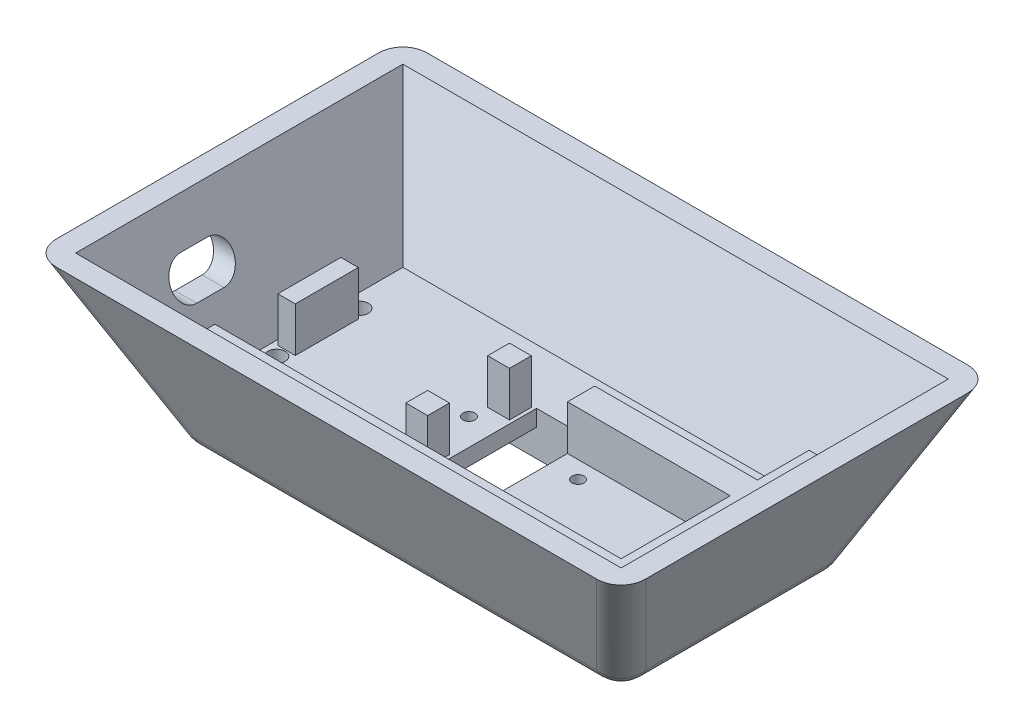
ISO-10303-21;
HEADER;
FILE_DESCRIPTION(('STEP AP214'),'2;1');
FILE_NAME('part.step','',(''),(''),'','','');
FILE_SCHEMA(('AUTOMOTIVE_DESIGN { 1 0 10303 214 1 1 1 1 }'));
ENDSEC;
DATA;
#1=APPLICATION_CONTEXT('core data for automotive mechanical design processes');
#2=APPLICATION_PROTOCOL_DEFINITION('international standard','automotive_design',2000,#1);
#3=PRODUCT_CONTEXT('',#1,'mechanical');
#4=PRODUCT('Part','Part','',(#3));
#5=PRODUCT_RELATED_PRODUCT_CATEGORY('part','',(#4));
#6=PRODUCT_DEFINITION_FORMATION('','',#4);
#7=PRODUCT_DEFINITION_CONTEXT('part definition',#1,'design');
#8=PRODUCT_DEFINITION('design','',#6,#7);
#9=PRODUCT_DEFINITION_SHAPE('','',#8);
#10=(LENGTH_UNIT() NAMED_UNIT(*) SI_UNIT(.MILLI.,.METRE.));
#11=(NAMED_UNIT(*) PLANE_ANGLE_UNIT() SI_UNIT($,.RADIAN.));
#12=(NAMED_UNIT(*) SI_UNIT($,.STERADIAN.) SOLID_ANGLE_UNIT());
#13=UNCERTAINTY_MEASURE_WITH_UNIT(LENGTH_MEASURE(1.E-05),#10,'distance_accuracy_value','');
#14=(GEOMETRIC_REPRESENTATION_CONTEXT(3) GLOBAL_UNCERTAINTY_ASSIGNED_CONTEXT((#13)) GLOBAL_UNIT_ASSIGNED_CONTEXT((#10,
#11,#12)) REPRESENTATION_CONTEXT('',''));
#15=CARTESIAN_POINT('',(0.,0.,0.));
#16=DIRECTION('',(0.,0.,1.));
#17=DIRECTION('',(1.,0.,0.));
#18=AXIS2_PLACEMENT_3D('',#15,#16,#17);
#19=CARTESIAN_POINT('',(0.,8.,0.));
#20=DIRECTION('',(0.,1.,0.));
#21=DIRECTION('',(0.,0.,1.));
#22=AXIS2_PLACEMENT_3D('',#19,#20,#21);
#23=PLANE('',#22);
#24=CARTESIAN_POINT('',(-37.1904612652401,8.,-9.26999999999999));
#25=DIRECTION('',(0.,1.,0.));
#26=DIRECTION('',(0.,0.,1.));
#27=AXIS2_PLACEMENT_3D('',#24,#25,#26);
#28=CIRCLE('',#27,1.6);
#29=CARTESIAN_POINT('',(-37.1904612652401,8.,-7.67));
#30=VERTEX_POINT('',#29);
#31=EDGE_CURVE('E543',#30,#30,#28,.T.);
#32=ORIENTED_EDGE('',*,*,#31,.F.);
#33=EDGE_LOOP('',(#32));
#34=FACE_BOUND('',#33,.T.);
#35=CARTESIAN_POINT('',(-37.19046126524,8.,5.98000000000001));
#36=DIRECTION('',(0.,1.,0.));
#37=DIRECTION('',(0.,0.,1.));
#38=AXIS2_PLACEMENT_3D('',#35,#36,#37);
#39=CIRCLE('',#38,1.6);
#40=CARTESIAN_POINT('',(-37.19046126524,8.,7.58));
#41=VERTEX_POINT('',#40);
#42=EDGE_CURVE('E546',#41,#41,#39,.T.);
#43=ORIENTED_EDGE('',*,*,#42,.F.);
#44=EDGE_LOOP('',(#43));
#45=FACE_BOUND('',#44,.T.);
#46=CARTESIAN_POINT('',(-10.,8.,-2.1));
#47=DIRECTION('',(0.,1.,0.));
#48=DIRECTION('',(0.,0.,1.));
#49=AXIS2_PLACEMENT_3D('',#46,#47,#48);
#50=CIRCLE('',#49,1.1);
#51=CARTESIAN_POINT('',(-10.,8.,-1.));
#52=VERTEX_POINT('',#51);
#53=EDGE_CURVE('E555',#52,#52,#50,.F.);
#54=ORIENTED_EDGE('',*,*,#53,.T.);
#55=EDGE_LOOP('',(#54));
#56=FACE_BOUND('',#55,.T.);
#57=CARTESIAN_POINT('',(10.,8.,-2.1));
#58=DIRECTION('',(0.,1.,0.));
#59=DIRECTION('',(0.,0.,1.));
#60=AXIS2_PLACEMENT_3D('',#57,#58,#59);
#61=CIRCLE('',#60,1.1);
#62=CARTESIAN_POINT('',(10.,8.,-1.));
#63=VERTEX_POINT('',#62);
#64=EDGE_CURVE('E558',#63,#63,#61,.F.);
#65=ORIENTED_EDGE('',*,*,#64,.T.);
#66=EDGE_LOOP('',(#65));
#67=FACE_BOUND('',#66,.T.);
#68=DIRECTION('',(1.,0.,0.));
#69=VECTOR('',#68,1.);
#70=CARTESIAN_POINT('',(-38.79046126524,8.,4.13000000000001));
#71=LINE('',#70,#69);
#72=CARTESIAN_POINT('',(-38.79046126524,8.,4.13000000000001));
#73=VERTEX_POINT('',#72);
#74=CARTESIAN_POINT('',(-35.59046126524,8.,4.13000000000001));
#75=VERTEX_POINT('',#74);
#76=EDGE_CURVE('E523',#73,#75,#71,.T.);
#77=ORIENTED_EDGE('',*,*,#76,.F.);
#78=DIRECTION('',(0.,0.,1.));
#79=VECTOR('',#78,1.);
#80=CARTESIAN_POINT('',(-38.79046126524,8.,-7.41999999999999));
#81=LINE('',#80,#79);
#82=CARTESIAN_POINT('',(-38.79046126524,8.,-7.41999999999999));
#83=VERTEX_POINT('',#82);
#84=EDGE_CURVE('E502',#83,#73,#81,.T.);
#85=ORIENTED_EDGE('',*,*,#84,.F.);
#86=DIRECTION('',(-1.,0.,0.));
#87=VECTOR('',#86,1.);
#88=CARTESIAN_POINT('',(-38.79046126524,8.,-7.41999999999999));
#89=LINE('',#88,#87);
#90=CARTESIAN_POINT('',(-35.59046126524,8.,-7.41999999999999));
#91=VERTEX_POINT('',#90);
#92=EDGE_CURVE('E514',#91,#83,#89,.T.);
#93=ORIENTED_EDGE('',*,*,#92,.F.);
#94=DIRECTION('',(0.,0.,-1.));
#95=VECTOR('',#94,1.);
#96=CARTESIAN_POINT('',(-35.59046126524,8.,-7.41999999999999));
#97=LINE('',#96,#95);
#98=EDGE_CURVE('E525',#75,#91,#97,.T.);
#99=ORIENTED_EDGE('',*,*,#98,.F.);
#100=EDGE_LOOP('',(#77,#85,#93,#99));
#101=FACE_BOUND('',#100,.T.);
#102=DIRECTION('',(1.,0.,0.));
#103=VECTOR('',#102,1.);
#104=CARTESIAN_POINT('',(-9.73046126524,8.,-5.26953873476));
#105=LINE('',#104,#103);
#106=CARTESIAN_POINT('',(-9.73046126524,8.,-5.26953873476));
#107=VERTEX_POINT('',#106);
#108=CARTESIAN_POINT('',(-5.73046126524,8.,-5.26953873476));
#109=VERTEX_POINT('',#108);
#110=EDGE_CURVE('E497',#107,#109,#105,.T.);
#111=ORIENTED_EDGE('',*,*,#110,.F.);
#112=DIRECTION('',(0.,0.,1.));
#113=VECTOR('',#112,1.);
#114=CARTESIAN_POINT('',(-9.73046126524,8.,-9.26953873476));
#115=LINE('',#114,#113);
#116=CARTESIAN_POINT('',(-9.73046126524,8.,-9.26953873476));
#117=VERTEX_POINT('',#116);
#118=EDGE_CURVE('E499',#117,#107,#115,.T.);
#119=ORIENTED_EDGE('',*,*,#118,.F.);
#120=DIRECTION('',(-1.,0.,0.));
#121=VECTOR('',#120,1.);
#122=CARTESIAN_POINT('',(-9.73046126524,8.,-9.26953873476));
#123=LINE('',#122,#121);
#124=CARTESIAN_POINT('',(-5.73046126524,8.,-9.26953873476));
#125=VERTEX_POINT('',#124);
#126=EDGE_CURVE('E491',#125,#117,#123,.T.);
#127=ORIENTED_EDGE('',*,*,#126,.F.);
#128=DIRECTION('',(0.,0.,-1.));
#129=VECTOR('',#128,1.);
#130=CARTESIAN_POINT('',(-5.73046126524,8.,-9.26953873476));
#131=LINE('',#130,#129);
#132=EDGE_CURVE('E493',#109,#125,#131,.T.);
#133=ORIENTED_EDGE('',*,*,#132,.F.);
#134=EDGE_LOOP('',(#111,#119,#127,#133));
#135=FACE_BOUND('',#134,.T.);
#136=DIRECTION('',(1.,0.,0.));
#137=VECTOR('',#136,1.);
#138=CARTESIAN_POINT('',(-9.73046126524,8.,9.73046126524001));
#139=LINE('',#138,#137);
#140=CARTESIAN_POINT('',(-9.73046126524,8.,9.73046126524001));
#141=VERTEX_POINT('',#140);
#142=CARTESIAN_POINT('',(-5.73046126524,8.,9.73046126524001));
#143=VERTEX_POINT('',#142);
#144=EDGE_CURVE('E468',#141,#143,#139,.T.);
#145=ORIENTED_EDGE('',*,*,#144,.F.);
#146=DIRECTION('',(0.,0.,1.));
#147=VECTOR('',#146,1.);
#148=CARTESIAN_POINT('',(-9.73046126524,8.,5.73046126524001));
#149=LINE('',#148,#147);
#150=CARTESIAN_POINT('',(-9.73046126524,8.,5.73046126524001));
#151=VERTEX_POINT('',#150);
#152=EDGE_CURVE('E470',#151,#141,#149,.T.);
#153=ORIENTED_EDGE('',*,*,#152,.F.);
#154=DIRECTION('',(-1.,0.,0.));
#155=VECTOR('',#154,1.);
#156=CARTESIAN_POINT('',(-9.73046126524,8.,5.73046126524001));
#157=LINE('',#156,#155);
#158=CARTESIAN_POINT('',(-5.73046126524,8.,5.73046126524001));
#159=VERTEX_POINT('',#158);
#160=EDGE_CURVE('E462',#159,#151,#157,.T.);
#161=ORIENTED_EDGE('',*,*,#160,.F.);
#162=DIRECTION('',(0.,0.,-1.));
#163=VECTOR('',#162,1.);
#164=CARTESIAN_POINT('',(-5.73046126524,8.,5.73046126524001));
#165=LINE('',#164,#163);
#166=EDGE_CURVE('E464',#143,#159,#165,.T.);
#167=ORIENTED_EDGE('',*,*,#166,.F.);
#168=EDGE_LOOP('',(#145,#153,#161,#167));
#169=FACE_BOUND('',#168,.T.);
#170=DIRECTION('',(-1.,0.,0.));
#171=VECTOR('',#170,1.);
#172=CARTESIAN_POINT('',(4.9,8.,-10.26953873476));
#173=LINE('',#172,#171);
#174=CARTESIAN_POINT('',(34.73046126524,8.,-10.26953873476));
#175=VERTEX_POINT('',#174);
#176=CARTESIAN_POINT('',(4.9,8.,-10.26953873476));
#177=VERTEX_POINT('',#176);
#178=EDGE_CURVE('E426',#175,#177,#173,.T.);
#179=ORIENTED_EDGE('',*,*,#178,.F.);
#180=DIRECTION('',(0.,0.,1.));
#181=VECTOR('',#180,1.);
#182=CARTESIAN_POINT('',(34.73046126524,8.,-10.26953873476));
#183=LINE('',#182,#181);
#184=CARTESIAN_POINT('',(34.73046126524,8.,-19.73046126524));
#185=VERTEX_POINT('',#184);
#186=EDGE_CURVE('E429',#185,#175,#183,.T.);
#187=ORIENTED_EDGE('',*,*,#186,.F.);
#188=DIRECTION('',(-1.,0.,0.));
#189=VECTOR('',#188,1.);
#190=CARTESIAN_POINT('',(0.,8.,-19.73046126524));
#191=LINE('',#190,#189);
#192=CARTESIAN_POINT('',(-39.73046126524,8.,-19.73046126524));
#193=VERTEX_POINT('',#192);
#194=EDGE_CURVE('E598',#185,#193,#191,.T.);
#195=ORIENTED_EDGE('',*,*,#194,.T.);
#196=DIRECTION('',(0.,0.,1.));
#197=VECTOR('',#196,1.);
#198=CARTESIAN_POINT('',(-39.73046126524,8.,0.));
#199=LINE('',#198,#197);
#200=CARTESIAN_POINT('',(-39.73046126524,8.,14.73046126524));
#201=VERTEX_POINT('',#200);
#202=EDGE_CURVE('E613',#193,#201,#199,.T.);
#203=ORIENTED_EDGE('',*,*,#202,.T.);
#204=DIRECTION('',(-1.,0.,0.));
#205=VECTOR('',#204,1.);
#206=CARTESIAN_POINT('',(-39.73046126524,8.,14.73046126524));
#207=LINE('',#206,#205);
#208=CARTESIAN_POINT('',(34.73046126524,8.,14.73046126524));
#209=VERTEX_POINT('',#208);
#210=EDGE_CURVE('E413',#209,#201,#207,.T.);
#211=ORIENTED_EDGE('',*,*,#210,.F.);
#212=DIRECTION('',(0.,0.,1.));
#213=VECTOR('',#212,1.);
#214=CARTESIAN_POINT('',(34.73046126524,8.,14.73046126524));
#215=LINE('',#214,#213);
#216=CARTESIAN_POINT('',(34.73046126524,8.,-5.26953873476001));
#217=VERTEX_POINT('',#216);
#218=EDGE_CURVE('E417',#217,#209,#215,.T.);
#219=ORIENTED_EDGE('',*,*,#218,.F.);
#220=DIRECTION('',(1.,0.,0.));
#221=VECTOR('',#220,1.);
#222=CARTESIAN_POINT('',(34.73046126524,8.,-5.26953873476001));
#223=LINE('',#222,#221);
#224=CARTESIAN_POINT('',(4.9,8.,-5.26953873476));
#225=VERTEX_POINT('',#224);
#226=EDGE_CURVE('E420',#225,#217,#223,.T.);
#227=ORIENTED_EDGE('',*,*,#226,.F.);
#228=DIRECTION('',(0.,0.,1.));
#229=VECTOR('',#228,1.);
#230=CARTESIAN_POINT('',(4.9,8.,9.6));
#231=LINE('',#230,#229);
#232=CARTESIAN_POINT('',(4.9,8.,9.6));
#233=VERTEX_POINT('',#232);
#234=EDGE_CURVE('E564',#225,#233,#231,.T.);
#235=ORIENTED_EDGE('',*,*,#234,.T.);
#236=DIRECTION('',(-1.,0.,0.));
#237=VECTOR('',#236,1.);
#238=CARTESIAN_POINT('',(4.9,8.,9.6));
#239=LINE('',#238,#237);
#240=CARTESIAN_POINT('',(-5.1,8.,9.6));
#241=VERTEX_POINT('',#240);
#242=EDGE_CURVE('E584',#233,#241,#239,.T.);
#243=ORIENTED_EDGE('',*,*,#242,.T.);
#244=DIRECTION('',(0.,0.,-1.));
#245=VECTOR('',#244,1.);
#246=CARTESIAN_POINT('',(-5.1,8.,9.6));
#247=LINE('',#246,#245);
#248=CARTESIAN_POINT('',(-5.1,8.,-9.6));
#249=VERTEX_POINT('',#248);
#250=EDGE_CURVE('E581',#241,#249,#247,.T.);
#251=ORIENTED_EDGE('',*,*,#250,.T.);
#252=DIRECTION('',(1.,0.,0.));
#253=VECTOR('',#252,1.);
#254=CARTESIAN_POINT('',(4.9,8.,-9.6));
#255=LINE('',#254,#253);
#256=CARTESIAN_POINT('',(4.9,8.,-9.6));
#257=VERTEX_POINT('',#256);
#258=EDGE_CURVE('E542',#249,#257,#255,.T.);
#259=ORIENTED_EDGE('',*,*,#258,.T.);
#260=DIRECTION('',(0.,0.,1.));
#261=VECTOR('',#260,1.);
#262=CARTESIAN_POINT('',(4.9,8.,-5.26953873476));
#263=LINE('',#262,#261);
#264=EDGE_CURVE('E423',#177,#257,#263,.T.);
#265=ORIENTED_EDGE('',*,*,#264,.F.);
#266=EDGE_LOOP('',(#179,#187,#195,#203,#211,#219,#227,#235,#243,#251,#259,#265));
#267=FACE_BOUND('',#266,.T.);
#268=ADVANCED_FACE('F37',(#34,#45,#56,#67,#101,#135,#169,#267),#23,.T.);
#269=CARTESIAN_POINT('',(0.,5.,0.));
#270=DIRECTION('',(0.,-1.,0.));
#271=DIRECTION('',(0.,0.,-1.));
#272=AXIS2_PLACEMENT_3D('',#269,#270,#271);
#273=PLANE('',#272);
#274=DIRECTION('',(0.,0.,-1.));
#275=VECTOR('',#274,1.);
#276=CARTESIAN_POINT('',(-5.1,5.,9.6));
#277=LINE('',#276,#275);
#278=CARTESIAN_POINT('',(-5.1,5.,9.6));
#279=VERTEX_POINT('',#278);
#280=CARTESIAN_POINT('',(-5.1,5.,-9.6));
#281=VERTEX_POINT('',#280);
#282=EDGE_CURVE('E578',#279,#281,#277,.T.);
#283=ORIENTED_EDGE('',*,*,#282,.F.);
#284=DIRECTION('',(-1.,0.,0.));
#285=VECTOR('',#284,1.);
#286=CARTESIAN_POINT('',(-15.1,5.,9.6));
#287=LINE('',#286,#285);
#288=CARTESIAN_POINT('',(-15.1,5.,9.6));
#289=VERTEX_POINT('',#288);
#290=EDGE_CURVE('E624',#279,#289,#287,.T.);
#291=ORIENTED_EDGE('',*,*,#290,.T.);
#292=DIRECTION('',(0.,0.,-1.));
#293=VECTOR('',#292,1.);
#294=CARTESIAN_POINT('',(-15.1,5.,9.6));
#295=LINE('',#294,#293);
#296=CARTESIAN_POINT('',(-15.1,5.,-9.6));
#297=VERTEX_POINT('',#296);
#298=EDGE_CURVE('E629',#289,#297,#295,.T.);
#299=ORIENTED_EDGE('',*,*,#298,.T.);
#300=DIRECTION('',(1.,0.,0.));
#301=VECTOR('',#300,1.);
#302=CARTESIAN_POINT('',(-15.1,5.,-9.6));
#303=LINE('',#302,#301);
#304=EDGE_CURVE('E633',#297,#281,#303,.T.);
#305=ORIENTED_EDGE('',*,*,#304,.T.);
#306=EDGE_LOOP('',(#283,#291,#299,#305));
#307=FACE_BOUND('',#306,.T.);
#308=CARTESIAN_POINT('',(-10.,5.,-2.1));
#309=DIRECTION('',(0.,-1.,0.));
#310=DIRECTION('',(0.,0.,-1.));
#311=AXIS2_PLACEMENT_3D('',#308,#309,#310);
#312=CIRCLE('',#311,1.1);
#313=CARTESIAN_POINT('',(-10.,5.,-3.2));
#314=VERTEX_POINT('',#313);
#315=EDGE_CURVE('E551',#314,#314,#312,.T.);
#316=ORIENTED_EDGE('',*,*,#315,.F.);
#317=EDGE_LOOP('',(#316));
#318=FACE_BOUND('',#317,.T.);
#319=ADVANCED_FACE('F809',(#307,#318),#273,.T.);
#320=CARTESIAN_POINT('',(40.,0.,-20.));
#321=DIRECTION('',(0.90630778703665,-0.4226182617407,0.));
#322=DIRECTION('',(0.4226182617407,0.90630778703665,0.));
#323=AXIS2_PLACEMENT_3D('',#320,#321,#322);
#324=PLANE('',#323);
#325=DIRECTION('',(0.,0.,1.));
#326=VECTOR('',#325,1.);
#327=CARTESIAN_POINT('',(53.98922974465,30.,-20.));
#328=LINE('',#327,#326);
#329=CARTESIAN_POINT('',(53.98922974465,30.,29.4576908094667));
#330=VERTEX_POINT('',#329);
#331=CARTESIAN_POINT('',(53.98922974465,30.,-29.4576908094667));
#332=VERTEX_POINT('',#331);
#333=EDGE_CURVE('E648',#330,#332,#328,.F.);
#334=ORIENTED_EDGE('',*,*,#333,.F.);
#335=DIRECTION('',(0.389281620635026,0.834817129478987,0.389281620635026));
#336=VECTOR('',#335,1.);
#337=CARTESIAN_POINT('',(34.6251030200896,-11.5265037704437,10.0935640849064));
#338=LINE('',#337,#336);
#339=CARTESIAN_POINT('',(41.3461876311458,2.8869086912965,16.8146486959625));
#340=VERTEX_POINT('',#339);
#341=EDGE_CURVE('E692',#330,#340,#338,.F.);
#342=ORIENTED_EDGE('',*,*,#341,.T.);
#343=DIRECTION('',(0.,0.,-1.));
#344=VECTOR('',#343,1.);
#345=CARTESIAN_POINT('',(41.3461876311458,2.8869086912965,-20.));
#346=LINE('',#345,#344);
#347=CARTESIAN_POINT('',(41.3461876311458,2.8869086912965,-16.8146486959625));
#348=VERTEX_POINT('',#347);
#349=EDGE_CURVE('E690',#340,#348,#346,.T.);
#350=ORIENTED_EDGE('',*,*,#349,.T.);
#351=DIRECTION('',(0.389281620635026,0.834817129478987,-0.389281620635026));
#352=VECTOR('',#351,1.);
#353=CARTESIAN_POINT('',(40.6867102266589,1.4726548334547,-16.1551712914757));
#354=LINE('',#353,#352);
#355=EDGE_CURVE('E688',#348,#332,#354,.T.);
#356=ORIENTED_EDGE('',*,*,#355,.T.);
#357=EDGE_LOOP('',(#334,#342,#350,#356));
#358=FACE_BOUND('',#357,.T.);
#359=ADVANCED_FACE('F772',(#358),#324,.T.);
#360=CARTESIAN_POINT('',(-40.,0.,-20.));
#361=DIRECTION('',(0.,-0.4226182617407,-0.90630778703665));
#362=DIRECTION('',(0.,0.90630778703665,-0.4226182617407));
#363=AXIS2_PLACEMENT_3D('',#360,#361,#362);
#364=PLANE('',#363);
#365=DIRECTION('',(1.,0.,0.));
#366=VECTOR('',#365,1.);
#367=CARTESIAN_POINT('',(-40.,30.,-33.98922974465));
#368=LINE('',#367,#366);
#369=CARTESIAN_POINT('',(49.4576908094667,30.,-33.98922974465));
#370=VERTEX_POINT('',#369);
#371=CARTESIAN_POINT('',(-49.4576908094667,30.,-33.98922974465));
#372=VERTEX_POINT('',#371);
#373=EDGE_CURVE('E657',#370,#372,#368,.F.);
#374=ORIENTED_EDGE('',*,*,#373,.F.);
#375=DIRECTION('',(0.389281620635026,0.834817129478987,-0.389281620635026));
#376=VECTOR('',#375,1.);
#377=CARTESIAN_POINT('',(24.0319568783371,-24.5256623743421,-8.56349581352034));
#378=LINE('',#377,#376);
#379=CARTESIAN_POINT('',(36.8146486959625,2.8869086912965,-21.3461876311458));
#380=VERTEX_POINT('',#379);
#381=EDGE_CURVE('E54',#370,#380,#378,.F.);
#382=ORIENTED_EDGE('',*,*,#381,.T.);
#383=DIRECTION('',(-1.,0.,0.));
#384=VECTOR('',#383,1.);
#385=CARTESIAN_POINT('',(-40.,2.8869086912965,-21.3461876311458));
#386=LINE('',#385,#384);
#387=CARTESIAN_POINT('',(-36.8146486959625,2.8869086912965,-21.3461876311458));
#388=VERTEX_POINT('',#387);
#389=EDGE_CURVE('E59',#380,#388,#386,.T.);
#390=ORIENTED_EDGE('',*,*,#389,.T.);
#391=DIRECTION('',(-0.389281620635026,0.834817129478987,-0.389281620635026));
#392=VECTOR('',#391,1.);
#393=CARTESIAN_POINT('',(-36.1551712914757,1.4726548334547,-20.6867102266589));
#394=LINE('',#393,#392);
#395=EDGE_CURVE('E694',#388,#372,#394,.T.);
#396=ORIENTED_EDGE('',*,*,#395,.T.);
#397=EDGE_LOOP('',(#374,#382,#390,#396));
#398=FACE_BOUND('',#397,.T.);
#399=ADVANCED_FACE('F766',(#398),#364,.T.);
#400=CARTESIAN_POINT('',(-40.,0.,-20.));
#401=DIRECTION('',(-0.90630778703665,-0.4226182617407,0.));
#402=DIRECTION('',(0.4226182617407,-0.90630778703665,0.));
#403=AXIS2_PLACEMENT_3D('',#400,#401,#402);
#404=PLANE('',#403);
#405=DIRECTION('',(0.,0.,-1.));
#406=VECTOR('',#405,1.);
#407=CARTESIAN_POINT('',(-50.9582299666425,23.5,13.855));
#408=LINE('',#407,#406);
#409=CARTESIAN_POINT('',(-50.9582299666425,23.5,8.855));
#410=VERTEX_POINT('',#409);
#411=CARTESIAN_POINT('',(-50.9582299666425,23.5,13.855));
#412=VERTEX_POINT('',#411);
#413=EDGE_CURVE('E369',#410,#412,#408,.F.);
#414=ORIENTED_EDGE('',*,*,#413,.T.);
#415=CARTESIAN_POINT('',(-49.4427300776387,20.25,13.855));
#416=DIRECTION('',(-0.90630778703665,-0.4226182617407,0.));
#417=DIRECTION('',(0.4226182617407,-0.90630778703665,0.));
#418=AXIS2_PLACEMENT_3D('',#415,#416,#417);
#419=ELLIPSE('',#418,3.5859782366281,3.25);
#420=CARTESIAN_POINT('',(-47.927230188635,17.,13.855));
#421=VERTEX_POINT('',#420);
#422=EDGE_CURVE('E372',#421,#412,#419,.T.);
#423=ORIENTED_EDGE('',*,*,#422,.F.);
#424=DIRECTION('',(0.,0.,-1.));
#425=VECTOR('',#424,1.);
#426=CARTESIAN_POINT('',(-47.927230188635,17.,13.855));
#427=LINE('',#426,#425);
#428=CARTESIAN_POINT('',(-47.927230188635,17.,8.855));
#429=VERTEX_POINT('',#428);
#430=EDGE_CURVE('E354',#429,#421,#427,.F.);
#431=ORIENTED_EDGE('',*,*,#430,.F.);
#432=CARTESIAN_POINT('',(-49.4427300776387,20.25,8.855));
#433=DIRECTION('',(-0.90630778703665,-0.4226182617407,0.));
#434=DIRECTION('',(0.4226182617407,-0.90630778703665,0.));
#435=AXIS2_PLACEMENT_3D('',#432,#433,#434);
#436=ELLIPSE('',#435,3.5859782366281,3.25);
#437=EDGE_CURVE('E341',#410,#429,#436,.T.);
#438=ORIENTED_EDGE('',*,*,#437,.F.);
#439=EDGE_LOOP('',(#414,#423,#431,#438));
#440=FACE_BOUND('',#439,.T.);
#441=DIRECTION('',(0.,0.,1.));
#442=VECTOR('',#441,1.);
#443=CARTESIAN_POINT('',(-41.3461876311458,2.8869086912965,-20.));
#444=LINE('',#443,#442);
#445=CARTESIAN_POINT('',(-41.3461876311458,2.8869086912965,-16.8146486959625));
#446=VERTEX_POINT('',#445);
#447=CARTESIAN_POINT('',(-41.3461876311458,2.8869086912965,16.8146486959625));
#448=VERTEX_POINT('',#447);
#449=EDGE_CURVE('E668',#446,#448,#444,.T.);
#450=ORIENTED_EDGE('',*,*,#449,.T.);
#451=DIRECTION('',(-0.389281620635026,0.834817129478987,0.389281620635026));
#452=VECTOR('',#451,1.);
#453=CARTESIAN_POINT('',(-34.6251030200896,-11.5265037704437,10.0935640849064));
#454=LINE('',#453,#452);
#455=CARTESIAN_POINT('',(-53.98922974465,30.,29.4576908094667));
#456=VERTEX_POINT('',#455);
#457=EDGE_CURVE('E671',#448,#456,#454,.T.);
#458=ORIENTED_EDGE('',*,*,#457,.T.);
#459=DIRECTION('',(0.,0.,-1.));
#460=VECTOR('',#459,1.);
#461=CARTESIAN_POINT('',(-53.98922974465,30.,-20.));
#462=LINE('',#461,#460);
#463=CARTESIAN_POINT('',(-53.98922974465,30.,-29.4576908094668));
#464=VERTEX_POINT('',#463);
#465=EDGE_CURVE('E660',#464,#456,#462,.F.);
#466=ORIENTED_EDGE('',*,*,#465,.F.);
#467=DIRECTION('',(-0.389281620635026,0.834817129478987,-0.389281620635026));
#468=VECTOR('',#467,1.);
#469=CARTESIAN_POINT('',(-40.6867102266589,1.4726548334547,-16.1551712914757));
#470=LINE('',#469,#468);
#471=EDGE_CURVE('E666',#464,#446,#470,.F.);
#472=ORIENTED_EDGE('',*,*,#471,.T.);
#473=EDGE_LOOP('',(#450,#458,#466,#472));
#474=FACE_BOUND('',#473,.T.);
#475=ADVANCED_FACE('F793',(#440,#474),#404,.T.);
#476=CARTESIAN_POINT('',(-40.,0.,20.));
#477=DIRECTION('',(0.,-0.4226182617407,0.90630778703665));
#478=DIRECTION('',(0.,-0.90630778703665,-0.4226182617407));
#479=AXIS2_PLACEMENT_3D('',#476,#477,#478);
#480=PLANE('',#479);
#481=DIRECTION('',(-1.,0.,0.));
#482=VECTOR('',#481,1.);
#483=CARTESIAN_POINT('',(-40.,30.,33.98922974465));
#484=LINE('',#483,#482);
#485=CARTESIAN_POINT('',(-49.4576908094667,30.,33.98922974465));
#486=VERTEX_POINT('',#485);
#487=CARTESIAN_POINT('',(49.4576908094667,30.,33.98922974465));
#488=VERTEX_POINT('',#487);
#489=EDGE_CURVE('E663',#486,#488,#484,.F.);
#490=ORIENTED_EDGE('',*,*,#489,.F.);
#491=DIRECTION('',(-0.389281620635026,0.834817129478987,0.389281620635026));
#492=VECTOR('',#491,1.);
#493=CARTESIAN_POINT('',(-36.1551712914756,1.4726548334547,20.6867102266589));
#494=LINE('',#493,#492);
#495=CARTESIAN_POINT('',(-36.8146486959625,2.8869086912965,21.3461876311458));
#496=VERTEX_POINT('',#495);
#497=EDGE_CURVE('E686',#486,#496,#494,.F.);
#498=ORIENTED_EDGE('',*,*,#497,.T.);
#499=DIRECTION('',(1.,0.,0.));
#500=VECTOR('',#499,1.);
#501=CARTESIAN_POINT('',(-40.,2.8869086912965,21.3461876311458));
#502=LINE('',#501,#500);
#503=CARTESIAN_POINT('',(36.8146486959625,2.8869086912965,21.3461876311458));
#504=VERTEX_POINT('',#503);
#505=EDGE_CURVE('E684',#496,#504,#502,.T.);
#506=ORIENTED_EDGE('',*,*,#505,.T.);
#507=DIRECTION('',(0.389281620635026,0.834817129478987,0.389281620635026));
#508=VECTOR('',#507,1.);
#509=CARTESIAN_POINT('',(24.0319568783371,-24.5256623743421,8.56349581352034));
#510=LINE('',#509,#508);
#511=EDGE_CURVE('E682',#504,#488,#510,.T.);
#512=ORIENTED_EDGE('',*,*,#511,.T.);
#513=EDGE_LOOP('',(#490,#498,#506,#512));
#514=FACE_BOUND('',#513,.T.);
#515=ADVANCED_FACE('F796',(#514),#480,.T.);
#516=CARTESIAN_POINT('',(0.,30.,0.));
#517=DIRECTION('',(0.,1.,0.));
#518=DIRECTION('',(0.,0.,1.));
#519=AXIS2_PLACEMENT_3D('',#516,#517,#518);
#520=PLANE('',#519);
#521=DIRECTION('',(-1.,0.,0.));
#522=VECTOR('',#521,1.);
#523=CARTESIAN_POINT('',(49.98922974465,30.,-29.98922974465));
#524=LINE('',#523,#522);
#525=CARTESIAN_POINT('',(49.98922974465,30.,-29.98922974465));
#526=VERTEX_POINT('',#525);
#527=CARTESIAN_POINT('',(-49.98922974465,30.,-29.98922974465));
#528=VERTEX_POINT('',#527);
#529=EDGE_CURVE('E554',#526,#528,#524,.T.);
#530=ORIENTED_EDGE('',*,*,#529,.F.);
#531=DIRECTION('',(0.,0.,-1.));
#532=VECTOR('',#531,1.);
#533=CARTESIAN_POINT('',(49.98922974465,30.,29.98922974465));
#534=LINE('',#533,#532);
#535=CARTESIAN_POINT('',(49.98922974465,30.,29.98922974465));
#536=VERTEX_POINT('',#535);
#537=EDGE_CURVE('E595',#536,#526,#534,.T.);
#538=ORIENTED_EDGE('',*,*,#537,.F.);
#539=DIRECTION('',(1.,0.,0.));
#540=VECTOR('',#539,1.);
#541=CARTESIAN_POINT('',(-49.98922974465,30.,29.98922974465));
#542=LINE('',#541,#540);
#543=CARTESIAN_POINT('',(-49.98922974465,30.,29.98922974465));
#544=VERTEX_POINT('',#543);
#545=EDGE_CURVE('E592',#544,#536,#542,.T.);
#546=ORIENTED_EDGE('',*,*,#545,.F.);
#547=DIRECTION('',(0.,0.,1.));
#548=VECTOR('',#547,1.);
#549=CARTESIAN_POINT('',(-49.98922974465,30.,-29.98922974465));
#550=LINE('',#549,#548);
#551=EDGE_CURVE('E589',#528,#544,#550,.T.);
#552=ORIENTED_EDGE('',*,*,#551,.F.);
#553=EDGE_LOOP('',(#530,#538,#546,#552));
#554=FACE_BOUND('',#553,.T.);
#555=ORIENTED_EDGE('',*,*,#465,.T.);
#556=CARTESIAN_POINT('',(-48.4723401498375,30.,28.4723401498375));
#557=DIRECTION('',(0.,1.,0.));
#558=DIRECTION('',(0.707106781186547,0.,-0.707106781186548));
#559=AXIS2_PLACEMENT_3D('',#556,#557,#558);
#560=ELLIPSE('',#559,5.98933565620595,5.);
#561=EDGE_CURVE('E11',#456,#486,#560,.T.);
#562=ORIENTED_EDGE('',*,*,#561,.T.);
#563=ORIENTED_EDGE('',*,*,#489,.T.);
#564=CARTESIAN_POINT('',(48.4723401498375,30.,28.4723401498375));
#565=DIRECTION('',(0.,1.,0.));
#566=DIRECTION('',(-0.707106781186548,0.,-0.707106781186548));
#567=AXIS2_PLACEMENT_3D('',#564,#565,#566);
#568=ELLIPSE('',#567,5.98933565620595,5.);
#569=EDGE_CURVE('E46',#488,#330,#568,.T.);
#570=ORIENTED_EDGE('',*,*,#569,.T.);
#571=ORIENTED_EDGE('',*,*,#333,.T.);
#572=CARTESIAN_POINT('',(48.4723401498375,30.,-28.4723401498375));
#573=DIRECTION('',(0.,1.,0.));
#574=DIRECTION('',(-0.707106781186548,0.,0.707106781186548));
#575=AXIS2_PLACEMENT_3D('',#572,#573,#574);
#576=ELLIPSE('',#575,5.98933565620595,5.);
#577=EDGE_CURVE('E700',#332,#370,#576,.T.);
#578=ORIENTED_EDGE('',*,*,#577,.T.);
#579=ORIENTED_EDGE('',*,*,#373,.T.);
#580=CARTESIAN_POINT('',(-48.4723401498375,30.,-28.4723401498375));
#581=DIRECTION('',(0.,1.,0.));
#582=DIRECTION('',(0.707106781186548,0.,0.707106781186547));
#583=AXIS2_PLACEMENT_3D('',#580,#581,#582);
#584=ELLIPSE('',#583,5.98933565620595,5.);
#585=EDGE_CURVE('E698',#372,#464,#584,.T.);
#586=ORIENTED_EDGE('',*,*,#585,.T.);
#587=EDGE_LOOP('',(#555,#562,#563,#570,#571,#578,#579,#586));
#588=FACE_BOUND('',#587,.T.);
#589=ADVANCED_FACE('F768',(#554,#588),#520,.T.);
#590=CARTESIAN_POINT('',(0.,0.,0.));
#591=DIRECTION('',(0.,1.,0.));
#592=DIRECTION('',(0.,0.,1.));
#593=AXIS2_PLACEMENT_3D('',#590,#591,#592);
#594=PLANE('',#593);
#595=DIRECTION('',(-1.,0.,0.));
#596=VECTOR('',#595,1.);
#597=CARTESIAN_POINT('',(0.,0.,16.8146486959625));
#598=LINE('',#597,#596);
#599=CARTESIAN_POINT('',(36.8146486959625,0.,16.8146486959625));
#600=VERTEX_POINT('',#599);
#601=CARTESIAN_POINT('',(-36.8146486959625,0.,16.8146486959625));
#602=VERTEX_POINT('',#601);
#603=EDGE_CURVE('E677',#600,#602,#598,.T.);
#604=ORIENTED_EDGE('',*,*,#603,.T.);
#605=DIRECTION('',(0.,0.,-1.));
#606=VECTOR('',#605,1.);
#607=CARTESIAN_POINT('',(-36.8146486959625,0.,0.));
#608=LINE('',#607,#606);
#609=CARTESIAN_POINT('',(-36.8146486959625,0.,-16.8146486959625));
#610=VERTEX_POINT('',#609);
#611=EDGE_CURVE('E679',#602,#610,#608,.T.);
#612=ORIENTED_EDGE('',*,*,#611,.T.);
#613=DIRECTION('',(1.,0.,0.));
#614=VECTOR('',#613,1.);
#615=CARTESIAN_POINT('',(0.,0.,-16.8146486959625));
#616=LINE('',#615,#614);
#617=CARTESIAN_POINT('',(36.8146486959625,0.,-16.8146486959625));
#618=VERTEX_POINT('',#617);
#619=EDGE_CURVE('E673',#610,#618,#616,.T.);
#620=ORIENTED_EDGE('',*,*,#619,.T.);
#621=DIRECTION('',(0.,0.,1.));
#622=VECTOR('',#621,1.);
#623=CARTESIAN_POINT('',(36.8146486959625,0.,0.));
#624=LINE('',#623,#622);
#625=EDGE_CURVE('E675',#618,#600,#624,.T.);
#626=ORIENTED_EDGE('',*,*,#625,.T.);
#627=EDGE_LOOP('',(#604,#612,#620,#626));
#628=FACE_BOUND('',#627,.T.);
#629=DIRECTION('',(-1.,0.,0.));
#630=VECTOR('',#629,1.);
#631=CARTESIAN_POINT('',(-15.1,0.,9.6));
#632=LINE('',#631,#630);
#633=CARTESIAN_POINT('',(15.1,0.,9.6));
#634=VERTEX_POINT('',#633);
#635=CARTESIAN_POINT('',(-15.1,0.,9.6));
#636=VERTEX_POINT('',#635);
#637=EDGE_CURVE('E638',#634,#636,#632,.T.);
#638=ORIENTED_EDGE('',*,*,#637,.F.);
#639=DIRECTION('',(0.,0.,1.));
#640=VECTOR('',#639,1.);
#641=CARTESIAN_POINT('',(15.1,0.,9.6));
#642=LINE('',#641,#640);
#643=CARTESIAN_POINT('',(15.1,0.,-9.6));
#644=VERTEX_POINT('',#643);
#645=EDGE_CURVE('E601',#644,#634,#642,.T.);
#646=ORIENTED_EDGE('',*,*,#645,.F.);
#647=DIRECTION('',(1.,0.,0.));
#648=VECTOR('',#647,1.);
#649=CARTESIAN_POINT('',(-15.1,0.,-9.6));
#650=LINE('',#649,#648);
#651=CARTESIAN_POINT('',(-15.1,0.,-9.6));
#652=VERTEX_POINT('',#651);
#653=EDGE_CURVE('E625',#652,#644,#650,.T.);
#654=ORIENTED_EDGE('',*,*,#653,.F.);
#655=DIRECTION('',(0.,0.,-1.));
#656=VECTOR('',#655,1.);
#657=CARTESIAN_POINT('',(-15.1,0.,9.6));
#658=LINE('',#657,#656);
#659=EDGE_CURVE('E641',#636,#652,#658,.T.);
#660=ORIENTED_EDGE('',*,*,#659,.F.);
#661=EDGE_LOOP('',(#638,#646,#654,#660));
#662=FACE_BOUND('',#661,.T.);
#663=ADVANCED_FACE('F748',(#628,#662),#594,.F.);
#664=CARTESIAN_POINT('',(15.1,5.,9.6));
#665=DIRECTION('',(1.,0.,0.));
#666=DIRECTION('',(0.,0.,-1.));
#667=AXIS2_PLACEMENT_3D('',#664,#665,#666);
#668=PLANE('',#667);
#669=ORIENTED_EDGE('',*,*,#645,.T.);
#670=DIRECTION('',(0.,-1.,0.));
#671=VECTOR('',#670,1.);
#672=CARTESIAN_POINT('',(15.1,5.,9.6));
#673=LINE('',#672,#671);
#674=CARTESIAN_POINT('',(15.1,5.,9.6));
#675=VERTEX_POINT('',#674);
#676=EDGE_CURVE('E636',#675,#634,#673,.T.);
#677=ORIENTED_EDGE('',*,*,#676,.F.);
#678=DIRECTION('',(0.,0.,1.));
#679=VECTOR('',#678,1.);
#680=CARTESIAN_POINT('',(15.1,5.,9.6));
#681=LINE('',#680,#679);
#682=CARTESIAN_POINT('',(15.1,5.,-9.6));
#683=VERTEX_POINT('',#682);
#684=EDGE_CURVE('E621',#683,#675,#681,.T.);
#685=ORIENTED_EDGE('',*,*,#684,.F.);
#686=DIRECTION('',(0.,-1.,0.));
#687=VECTOR('',#686,1.);
#688=CARTESIAN_POINT('',(15.1,5.,-9.6));
#689=LINE('',#688,#687);
#690=EDGE_CURVE('E646',#683,#644,#689,.T.);
#691=ORIENTED_EDGE('',*,*,#690,.T.);
#692=EDGE_LOOP('',(#669,#677,#685,#691));
#693=FACE_BOUND('',#692,.T.);
#694=ADVANCED_FACE('F846',(#693),#668,.F.);
#695=CARTESIAN_POINT('',(-15.1,5.,-9.6));
#696=DIRECTION('',(0.,0.,-1.));
#697=DIRECTION('',(-1.,0.,0.));
#698=AXIS2_PLACEMENT_3D('',#695,#696,#697);
#699=PLANE('',#698);
#700=ORIENTED_EDGE('',*,*,#653,.T.);
#701=ORIENTED_EDGE('',*,*,#690,.F.);
#702=CARTESIAN_POINT('',(4.9,5.,-9.6));
#703=VERTEX_POINT('',#702);
#704=EDGE_CURVE('E632',#703,#683,#303,.T.);
#705=ORIENTED_EDGE('',*,*,#704,.F.);
#706=DIRECTION('',(0.,-1.,0.));
#707=VECTOR('',#706,1.);
#708=CARTESIAN_POINT('',(4.9,30.001,-9.6));
#709=LINE('',#708,#707);
#710=EDGE_CURVE('E571',#257,#703,#709,.T.);
#711=ORIENTED_EDGE('',*,*,#710,.F.);
#712=ORIENTED_EDGE('',*,*,#258,.F.);
#713=DIRECTION('',(0.,-1.,0.));
#714=VECTOR('',#713,1.);
#715=CARTESIAN_POINT('',(-5.1,30.001,-9.6));
#716=LINE('',#715,#714);
#717=EDGE_CURVE('E568',#249,#281,#716,.T.);
#718=ORIENTED_EDGE('',*,*,#717,.T.);
#719=ORIENTED_EDGE('',*,*,#304,.F.);
#720=DIRECTION('',(0.,-1.,0.));
#721=VECTOR('',#720,1.);
#722=CARTESIAN_POINT('',(-15.1,5.,-9.6));
#723=LINE('',#722,#721);
#724=EDGE_CURVE('E649',#297,#652,#723,.T.);
#725=ORIENTED_EDGE('',*,*,#724,.T.);
#726=EDGE_LOOP('',(#700,#701,#705,#711,#712,#718,#719,#725));
#727=FACE_BOUND('',#726,.T.);
#728=ADVANCED_FACE('F842',(#727),#699,.F.);
#729=CARTESIAN_POINT('',(-15.1,5.,9.6));
#730=DIRECTION('',(-1.,0.,0.));
#731=DIRECTION('',(0.,0.,1.));
#732=AXIS2_PLACEMENT_3D('',#729,#730,#731);
#733=PLANE('',#732);
#734=ORIENTED_EDGE('',*,*,#659,.T.);
#735=ORIENTED_EDGE('',*,*,#724,.F.);
#736=ORIENTED_EDGE('',*,*,#298,.F.);
#737=DIRECTION('',(0.,-1.,0.));
#738=VECTOR('',#737,1.);
#739=CARTESIAN_POINT('',(-15.1,5.,9.6));
#740=LINE('',#739,#738);
#741=EDGE_CURVE('E651',#289,#636,#740,.T.);
#742=ORIENTED_EDGE('',*,*,#741,.T.);
#743=EDGE_LOOP('',(#734,#735,#736,#742));
#744=FACE_BOUND('',#743,.T.);
#745=ADVANCED_FACE('F845',(#744),#733,.F.);
#746=CARTESIAN_POINT('',(-15.1,5.,9.6));
#747=DIRECTION('',(0.,0.,1.));
#748=DIRECTION('',(1.,0.,0.));
#749=AXIS2_PLACEMENT_3D('',#746,#747,#748);
#750=PLANE('',#749);
#751=ORIENTED_EDGE('',*,*,#637,.T.);
#752=ORIENTED_EDGE('',*,*,#741,.F.);
#753=ORIENTED_EDGE('',*,*,#290,.F.);
#754=DIRECTION('',(0.,-1.,0.));
#755=VECTOR('',#754,1.);
#756=CARTESIAN_POINT('',(-5.1,30.001,9.6));
#757=LINE('',#756,#755);
#758=EDGE_CURVE('E567',#241,#279,#757,.T.);
#759=ORIENTED_EDGE('',*,*,#758,.F.);
#760=ORIENTED_EDGE('',*,*,#242,.F.);
#761=DIRECTION('',(0.,-1.,0.));
#762=VECTOR('',#761,1.);
#763=CARTESIAN_POINT('',(4.9,30.001,9.6));
#764=LINE('',#763,#762);
#765=CARTESIAN_POINT('',(4.9,5.,9.6));
#766=VERTEX_POINT('',#765);
#767=EDGE_CURVE('E573',#233,#766,#764,.T.);
#768=ORIENTED_EDGE('',*,*,#767,.T.);
#769=EDGE_CURVE('E626',#675,#766,#287,.T.);
#770=ORIENTED_EDGE('',*,*,#769,.F.);
#771=ORIENTED_EDGE('',*,*,#676,.T.);
#772=EDGE_LOOP('',(#751,#752,#753,#759,#760,#768,#770,#771));
#773=FACE_BOUND('',#772,.T.);
#774=ADVANCED_FACE('F840',(#773),#750,.F.);
#775=DIRECTION('',(0.,0.,1.));
#776=VECTOR('',#775,1.);
#777=CARTESIAN_POINT('',(4.9,5.,9.6));
#778=LINE('',#777,#776);
#779=EDGE_CURVE('E570',#703,#766,#778,.T.);
#780=ORIENTED_EDGE('',*,*,#779,.F.);
#781=ORIENTED_EDGE('',*,*,#704,.T.);
#782=ORIENTED_EDGE('',*,*,#684,.T.);
#783=ORIENTED_EDGE('',*,*,#769,.T.);
#784=EDGE_LOOP('',(#780,#781,#782,#783));
#785=FACE_BOUND('',#784,.T.);
#786=CARTESIAN_POINT('',(10.,5.,-2.1));
#787=DIRECTION('',(0.,-1.,0.));
#788=DIRECTION('',(0.,0.,-1.));
#789=AXIS2_PLACEMENT_3D('',#786,#787,#788);
#790=CIRCLE('',#789,1.1);
#791=CARTESIAN_POINT('',(10.,5.,-3.2));
#792=VERTEX_POINT('',#791);
#793=EDGE_CURVE('E561',#792,#792,#790,.T.);
#794=ORIENTED_EDGE('',*,*,#793,.F.);
#795=EDGE_LOOP('',(#794));
#796=FACE_BOUND('',#795,.T.);
#797=ADVANCED_FACE('F817',(#785,#796),#273,.T.);
#798=CARTESIAN_POINT('',(49.98922974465,30.,-29.98922974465));
#799=DIRECTION('',(0.,-0.4226182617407,-0.90630778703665));
#800=DIRECTION('',(0.,0.90630778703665,-0.4226182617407));
#801=AXIS2_PLACEMENT_3D('',#798,#799,#800);
#802=PLANE('',#801);
#803=ORIENTED_EDGE('',*,*,#529,.T.);
#804=DIRECTION('',(-0.389281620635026,0.834817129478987,-0.389281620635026));
#805=VECTOR('',#804,1.);
#806=CARTESIAN_POINT('',(-34.8384759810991,-2.49089629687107,-14.8384759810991));
#807=LINE('',#806,#805);
#808=EDGE_CURVE('E603',#193,#528,#807,.T.);
#809=ORIENTED_EDGE('',*,*,#808,.F.);
#810=ORIENTED_EDGE('',*,*,#194,.F.);
#811=CARTESIAN_POINT('',(39.73046126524,8.,-19.73046126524));
#812=VERTEX_POINT('',#811);
#813=EDGE_CURVE('E610',#812,#185,#191,.T.);
#814=ORIENTED_EDGE('',*,*,#813,.F.);
#815=DIRECTION('',(0.389281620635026,0.834817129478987,-0.389281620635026));
#816=VECTOR('',#815,1.);
#817=CARTESIAN_POINT('',(40.9000831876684,10.5082623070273,-20.9000831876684));
#818=LINE('',#817,#816);
#819=EDGE_CURVE('E599',#812,#526,#818,.T.);
#820=ORIENTED_EDGE('',*,*,#819,.T.);
#821=EDGE_LOOP('',(#803,#809,#810,#814,#820));
#822=FACE_BOUND('',#821,.T.);
#823=ADVANCED_FACE('F824',(#822),#802,.F.);
#824=CARTESIAN_POINT('',(49.98922974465,30.,29.98922974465));
#825=DIRECTION('',(0.90630778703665,-0.4226182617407,0.));
#826=DIRECTION('',(0.4226182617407,0.90630778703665,0.));
#827=AXIS2_PLACEMENT_3D('',#824,#825,#826);
#828=PLANE('',#827);
#829=ORIENTED_EDGE('',*,*,#537,.T.);
#830=ORIENTED_EDGE('',*,*,#819,.F.);
#831=DIRECTION('',(0.,0.,-1.));
#832=VECTOR('',#831,1.);
#833=CARTESIAN_POINT('',(39.73046126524,8.,0.));
#834=LINE('',#833,#832);
#835=CARTESIAN_POINT('',(39.73046126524,8.,19.73046126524));
#836=VERTEX_POINT('',#835);
#837=EDGE_CURVE('E607',#836,#812,#834,.T.);
#838=ORIENTED_EDGE('',*,*,#837,.F.);
#839=DIRECTION('',(0.389281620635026,0.834817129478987,0.389281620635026));
#840=VECTOR('',#839,1.);
#841=CARTESIAN_POINT('',(34.8384759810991,-2.49089629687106,14.8384759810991));
#842=LINE('',#841,#840);
#843=EDGE_CURVE('E602',#836,#536,#842,.T.);
#844=ORIENTED_EDGE('',*,*,#843,.T.);
#845=EDGE_LOOP('',(#829,#830,#838,#844));
#846=FACE_BOUND('',#845,.T.);
#847=ADVANCED_FACE('F827',(#846),#828,.F.);
#848=CARTESIAN_POINT('',(-49.98922974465,30.,29.98922974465));
#849=DIRECTION('',(0.,-0.4226182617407,0.90630778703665));
#850=DIRECTION('',(0.,-0.90630778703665,-0.4226182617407));
#851=AXIS2_PLACEMENT_3D('',#848,#849,#850);
#852=PLANE('',#851);
#853=ORIENTED_EDGE('',*,*,#545,.T.);
#854=ORIENTED_EDGE('',*,*,#843,.F.);
#855=DIRECTION('',(1.,0.,0.));
#856=VECTOR('',#855,1.);
#857=CARTESIAN_POINT('',(0.,8.,19.73046126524));
#858=LINE('',#857,#856);
#859=CARTESIAN_POINT('',(-39.73046126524,8.,19.73046126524));
#860=VERTEX_POINT('',#859);
#861=EDGE_CURVE('E616',#860,#836,#858,.T.);
#862=ORIENTED_EDGE('',*,*,#861,.F.);
#863=DIRECTION('',(-0.389281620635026,0.834817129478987,0.389281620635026));
#864=VECTOR('',#863,1.);
#865=CARTESIAN_POINT('',(-40.9000831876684,10.5082623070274,20.9000831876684));
#866=LINE('',#865,#864);
#867=EDGE_CURVE('E606',#860,#544,#866,.T.);
#868=ORIENTED_EDGE('',*,*,#867,.T.);
#869=EDGE_LOOP('',(#853,#854,#862,#868));
#870=FACE_BOUND('',#869,.T.);
#871=ADVANCED_FACE('F832',(#870),#852,.F.);
#872=CARTESIAN_POINT('',(-49.98922974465,30.,-29.98922974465));
#873=DIRECTION('',(-0.90630778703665,-0.4226182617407,0.));
#874=DIRECTION('',(0.4226182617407,-0.90630778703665,0.));
#875=AXIS2_PLACEMENT_3D('',#872,#873,#874);
#876=PLANE('',#875);
#877=DIRECTION('',(0.,0.,-1.));
#878=VECTOR('',#877,1.);
#879=CARTESIAN_POINT('',(-43.927230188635,17.,13.855));
#880=LINE('',#879,#878);
#881=CARTESIAN_POINT('',(-43.927230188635,17.,13.855));
#882=VERTEX_POINT('',#881);
#883=CARTESIAN_POINT('',(-43.927230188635,17.,8.855));
#884=VERTEX_POINT('',#883);
#885=EDGE_CURVE('E350',#882,#884,#880,.T.);
#886=ORIENTED_EDGE('',*,*,#885,.F.);
#887=CARTESIAN_POINT('',(-45.4427300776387,20.25,13.855));
#888=DIRECTION('',(-0.90630778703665,-0.4226182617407,0.));
#889=DIRECTION('',(0.4226182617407,-0.90630778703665,0.));
#890=AXIS2_PLACEMENT_3D('',#887,#888,#889);
#891=ELLIPSE('',#890,3.5859782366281,3.25);
#892=CARTESIAN_POINT('',(-46.9582299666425,23.5,13.855));
#893=VERTEX_POINT('',#892);
#894=EDGE_CURVE('E362',#893,#882,#891,.F.);
#895=ORIENTED_EDGE('',*,*,#894,.F.);
#896=DIRECTION('',(0.,0.,-1.));
#897=VECTOR('',#896,1.);
#898=CARTESIAN_POINT('',(-46.9582299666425,23.5,13.855));
#899=LINE('',#898,#897);
#900=CARTESIAN_POINT('',(-46.9582299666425,23.5,8.855));
#901=VERTEX_POINT('',#900);
#902=EDGE_CURVE('E360',#893,#901,#899,.T.);
#903=ORIENTED_EDGE('',*,*,#902,.T.);
#904=CARTESIAN_POINT('',(-45.4427300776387,20.25,8.855));
#905=DIRECTION('',(-0.90630778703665,-0.4226182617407,0.));
#906=DIRECTION('',(0.4226182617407,-0.90630778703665,0.));
#907=AXIS2_PLACEMENT_3D('',#904,#905,#906);
#908=ELLIPSE('',#907,3.5859782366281,3.25);
#909=EDGE_CURVE('E338',#884,#901,#908,.F.);
#910=ORIENTED_EDGE('',*,*,#909,.F.);
#911=EDGE_LOOP('',(#886,#895,#903,#910));
#912=FACE_BOUND('',#911,.T.);
#913=ORIENTED_EDGE('',*,*,#551,.T.);
#914=ORIENTED_EDGE('',*,*,#867,.F.);
#915=DIRECTION('',(0.,0.,1.));
#916=VECTOR('',#915,1.);
#917=CARTESIAN_POINT('',(-39.73046126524,8.,19.73046126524));
#918=LINE('',#917,#916);
#919=EDGE_CURVE('E410',#201,#860,#918,.T.);
#920=ORIENTED_EDGE('',*,*,#919,.F.);
#921=ORIENTED_EDGE('',*,*,#202,.F.);
#922=ORIENTED_EDGE('',*,*,#808,.T.);
#923=EDGE_LOOP('',(#913,#914,#920,#921,#922));
#924=FACE_BOUND('',#923,.T.);
#925=ADVANCED_FACE('F357',(#912,#924),#876,.F.);
#926=CARTESIAN_POINT('',(-5.1,30.001,9.6));
#927=DIRECTION('',(-1.,0.,0.));
#928=DIRECTION('',(0.,0.,1.));
#929=AXIS2_PLACEMENT_3D('',#926,#927,#928);
#930=PLANE('',#929);
#931=ORIENTED_EDGE('',*,*,#758,.T.);
#932=ORIENTED_EDGE('',*,*,#282,.T.);
#933=ORIENTED_EDGE('',*,*,#717,.F.);
#934=ORIENTED_EDGE('',*,*,#250,.F.);
#935=EDGE_LOOP('',(#931,#932,#933,#934));
#936=FACE_BOUND('',#935,.T.);
#937=ADVANCED_FACE('F831',(#936),#930,.F.);
#938=CARTESIAN_POINT('',(4.9,30.001,9.6));
#939=DIRECTION('',(1.,0.,0.));
#940=DIRECTION('',(0.,0.,-1.));
#941=AXIS2_PLACEMENT_3D('',#938,#939,#940);
#942=PLANE('',#941);
#943=ORIENTED_EDGE('',*,*,#710,.T.);
#944=ORIENTED_EDGE('',*,*,#779,.T.);
#945=ORIENTED_EDGE('',*,*,#767,.F.);
#946=ORIENTED_EDGE('',*,*,#234,.F.);
#947=DIRECTION('',(0.,-1.,0.));
#948=VECTOR('',#947,1.);
#949=CARTESIAN_POINT('',(4.9,16.2,-5.26953873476));
#950=LINE('',#949,#948);
#951=CARTESIAN_POINT('',(4.9,16.2,-5.26953873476));
#952=VERTEX_POINT('',#951);
#953=EDGE_CURVE('E394',#952,#225,#950,.T.);
#954=ORIENTED_EDGE('',*,*,#953,.F.);
#955=DIRECTION('',(0.,0.,1.));
#956=VECTOR('',#955,1.);
#957=CARTESIAN_POINT('',(4.9,16.2,-5.26953873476));
#958=LINE('',#957,#956);
#959=CARTESIAN_POINT('',(4.9,16.2,-10.26953873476));
#960=VERTEX_POINT('',#959);
#961=EDGE_CURVE('E440',#960,#952,#958,.T.);
#962=ORIENTED_EDGE('',*,*,#961,.F.);
#963=DIRECTION('',(0.,-1.,0.));
#964=VECTOR('',#963,1.);
#965=CARTESIAN_POINT('',(4.9,16.2,-10.26953873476));
#966=LINE('',#965,#964);
#967=EDGE_CURVE('E391',#960,#177,#966,.T.);
#968=ORIENTED_EDGE('',*,*,#967,.T.);
#969=ORIENTED_EDGE('',*,*,#264,.T.);
#970=EDGE_LOOP('',(#943,#944,#945,#946,#954,#962,#968,#969));
#971=FACE_BOUND('',#970,.T.);
#972=ADVANCED_FACE('F822',(#971),#942,.F.);
#973=CARTESIAN_POINT('',(10.,30.001,-2.1));
#974=DIRECTION('',(0.,-1.,0.));
#975=DIRECTION('',(0.,0.,-1.));
#976=AXIS2_PLACEMENT_3D('',#973,#974,#975);
#977=CYLINDRICAL_SURFACE('',#976,1.1);
#978=ORIENTED_EDGE('',*,*,#64,.F.);
#979=EDGE_LOOP('',(#978));
#980=FACE_BOUND('',#979,.T.);
#981=ORIENTED_EDGE('',*,*,#793,.T.);
#982=EDGE_LOOP('',(#981));
#983=FACE_BOUND('',#982,.T.);
#984=ADVANCED_FACE('F1023',(#980,#983),#977,.F.);
#985=CARTESIAN_POINT('',(-10.,30.001,-2.1));
#986=DIRECTION('',(0.,-1.,0.));
#987=DIRECTION('',(0.,0.,-1.));
#988=AXIS2_PLACEMENT_3D('',#985,#986,#987);
#989=CYLINDRICAL_SURFACE('',#988,1.1);
#990=ORIENTED_EDGE('',*,*,#53,.F.);
#991=EDGE_LOOP('',(#990));
#992=FACE_BOUND('',#991,.T.);
#993=ORIENTED_EDGE('',*,*,#315,.T.);
#994=EDGE_LOOP('',(#993));
#995=FACE_BOUND('',#994,.T.);
#996=ADVANCED_FACE('F1016',(#992,#995),#989,.F.);
#997=CARTESIAN_POINT('',(-37.19046126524,3.25,5.98000000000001));
#998=DIRECTION('',(0.,1.,0.));
#999=DIRECTION('',(0.,0.,1.));
#1000=AXIS2_PLACEMENT_3D('',#997,#998,#999);
#1001=CYLINDRICAL_SURFACE('',#1000,1.6);
#1002=CARTESIAN_POINT('',(-37.19046126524,3.25,5.98000000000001));
#1003=DIRECTION('',(0.,1.,0.));
#1004=DIRECTION('',(0.,0.,1.));
#1005=AXIS2_PLACEMENT_3D('',#1002,#1003,#1004);
#1006=CIRCLE('',#1005,1.6);
#1007=CARTESIAN_POINT('',(-37.19046126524,3.25,7.58));
#1008=VERTEX_POINT('',#1007);
#1009=EDGE_CURVE('E538',#1008,#1008,#1006,.T.);
#1010=ORIENTED_EDGE('',*,*,#1009,.F.);
#1011=EDGE_LOOP('',(#1010));
#1012=FACE_BOUND('',#1011,.T.);
#1013=ORIENTED_EDGE('',*,*,#42,.T.);
#1014=EDGE_LOOP('',(#1013));
#1015=FACE_BOUND('',#1014,.T.);
#1016=ADVANCED_FACE('F1013',(#1012,#1015),#1001,.F.);
#1017=CARTESIAN_POINT('',(-37.19046126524,3.25,5.98000000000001));
#1018=DIRECTION('',(0.,1.,0.));
#1019=DIRECTION('',(0.,0.,1.));
#1020=AXIS2_PLACEMENT_3D('',#1017,#1018,#1019);
#1021=PLANE('',#1020);
#1022=ORIENTED_EDGE('',*,*,#1009,.T.);
#1023=EDGE_LOOP('',(#1022));
#1024=FACE_BOUND('',#1023,.T.);
#1025=ADVANCED_FACE('F1011',(#1024),#1021,.T.);
#1026=CARTESIAN_POINT('',(-37.1904612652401,3.25,-9.26999999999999));
#1027=DIRECTION('',(0.,1.,0.));
#1028=DIRECTION('',(0.,0.,1.));
#1029=AXIS2_PLACEMENT_3D('',#1026,#1027,#1028);
#1030=CYLINDRICAL_SURFACE('',#1029,1.6);
#1031=CARTESIAN_POINT('',(-37.1904612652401,3.25,-9.26999999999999));
#1032=DIRECTION('',(0.,1.,0.));
#1033=DIRECTION('',(0.,0.,1.));
#1034=AXIS2_PLACEMENT_3D('',#1031,#1032,#1033);
#1035=CIRCLE('',#1034,1.6);
#1036=CARTESIAN_POINT('',(-37.1904612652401,3.25,-7.67));
#1037=VERTEX_POINT('',#1036);
#1038=EDGE_CURVE('E539',#1037,#1037,#1035,.T.);
#1039=ORIENTED_EDGE('',*,*,#1038,.F.);
#1040=EDGE_LOOP('',(#1039));
#1041=FACE_BOUND('',#1040,.T.);
#1042=ORIENTED_EDGE('',*,*,#31,.T.);
#1043=EDGE_LOOP('',(#1042));
#1044=FACE_BOUND('',#1043,.T.);
#1045=ADVANCED_FACE('F1007',(#1041,#1044),#1030,.F.);
#1046=CARTESIAN_POINT('',(-37.1904612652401,3.25,-9.26999999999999));
#1047=DIRECTION('',(0.,1.,0.));
#1048=DIRECTION('',(0.,0.,1.));
#1049=AXIS2_PLACEMENT_3D('',#1046,#1047,#1048);
#1050=PLANE('',#1049);
#1051=ORIENTED_EDGE('',*,*,#1038,.T.);
#1052=EDGE_LOOP('',(#1051));
#1053=FACE_BOUND('',#1052,.T.);
#1054=ADVANCED_FACE('F1003',(#1053),#1050,.T.);
#1055=CARTESIAN_POINT('',(-38.79046126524,16.2,-7.41999999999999));
#1056=DIRECTION('',(1.,0.,0.));
#1057=DIRECTION('',(0.,0.,-1.));
#1058=AXIS2_PLACEMENT_3D('',#1055,#1056,#1057);
#1059=PLANE('',#1058);
#1060=ORIENTED_EDGE('',*,*,#84,.T.);
#1061=DIRECTION('',(0.,-1.,0.));
#1062=VECTOR('',#1061,1.);
#1063=CARTESIAN_POINT('',(-38.79046126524,16.2,4.13000000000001));
#1064=LINE('',#1063,#1062);
#1065=CARTESIAN_POINT('',(-38.79046126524,16.2,4.13000000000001));
#1066=VERTEX_POINT('',#1065);
#1067=EDGE_CURVE('E536',#1066,#73,#1064,.T.);
#1068=ORIENTED_EDGE('',*,*,#1067,.F.);
#1069=DIRECTION('',(0.,0.,1.));
#1070=VECTOR('',#1069,1.);
#1071=CARTESIAN_POINT('',(-38.79046126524,16.2,-7.41999999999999));
#1072=LINE('',#1071,#1070);
#1073=CARTESIAN_POINT('',(-38.79046126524,16.2,-7.41999999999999));
#1074=VERTEX_POINT('',#1073);
#1075=EDGE_CURVE('E510',#1074,#1066,#1072,.T.);
#1076=ORIENTED_EDGE('',*,*,#1075,.F.);
#1077=DIRECTION('',(0.,-1.,0.));
#1078=VECTOR('',#1077,1.);
#1079=CARTESIAN_POINT('',(-38.79046126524,16.2,-7.41999999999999));
#1080=LINE('',#1079,#1078);
#1081=EDGE_CURVE('E520',#1074,#83,#1080,.T.);
#1082=ORIENTED_EDGE('',*,*,#1081,.T.);
#1083=EDGE_LOOP('',(#1060,#1068,#1076,#1082));
#1084=FACE_BOUND('',#1083,.T.);
#1085=ADVANCED_FACE('F999',(#1084),#1059,.F.);
#1086=CARTESIAN_POINT('',(-38.79046126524,16.2,4.13000000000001));
#1087=DIRECTION('',(0.,0.,-1.));
#1088=DIRECTION('',(-1.,0.,0.));
#1089=AXIS2_PLACEMENT_3D('',#1086,#1087,#1088);
#1090=PLANE('',#1089);
#1091=ORIENTED_EDGE('',*,*,#76,.T.);
#1092=DIRECTION('',(0.,-1.,0.));
#1093=VECTOR('',#1092,1.);
#1094=CARTESIAN_POINT('',(-35.59046126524,16.2,4.13000000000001));
#1095=LINE('',#1094,#1093);
#1096=CARTESIAN_POINT('',(-35.59046126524,16.2,4.13000000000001));
#1097=VERTEX_POINT('',#1096);
#1098=EDGE_CURVE('E533',#1097,#75,#1095,.T.);
#1099=ORIENTED_EDGE('',*,*,#1098,.F.);
#1100=DIRECTION('',(1.,0.,0.));
#1101=VECTOR('',#1100,1.);
#1102=CARTESIAN_POINT('',(-38.79046126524,16.2,4.13000000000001));
#1103=LINE('',#1102,#1101);
#1104=EDGE_CURVE('E513',#1066,#1097,#1103,.T.);
#1105=ORIENTED_EDGE('',*,*,#1104,.F.);
#1106=ORIENTED_EDGE('',*,*,#1067,.T.);
#1107=EDGE_LOOP('',(#1091,#1099,#1105,#1106));
#1108=FACE_BOUND('',#1107,.T.);
#1109=ADVANCED_FACE('F995',(#1108),#1090,.F.);
#1110=CARTESIAN_POINT('',(-35.59046126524,16.2,-7.41999999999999));
#1111=DIRECTION('',(-1.,0.,0.));
#1112=DIRECTION('',(0.,0.,1.));
#1113=AXIS2_PLACEMENT_3D('',#1110,#1111,#1112);
#1114=PLANE('',#1113);
#1115=ORIENTED_EDGE('',*,*,#98,.T.);
#1116=DIRECTION('',(0.,-1.,0.));
#1117=VECTOR('',#1116,1.);
#1118=CARTESIAN_POINT('',(-35.59046126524,16.2,-7.41999999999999));
#1119=LINE('',#1118,#1117);
#1120=CARTESIAN_POINT('',(-35.59046126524,16.2,-7.41999999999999));
#1121=VERTEX_POINT('',#1120);
#1122=EDGE_CURVE('E531',#1121,#91,#1119,.T.);
#1123=ORIENTED_EDGE('',*,*,#1122,.F.);
#1124=DIRECTION('',(0.,0.,-1.));
#1125=VECTOR('',#1124,1.);
#1126=CARTESIAN_POINT('',(-35.59046126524,16.2,-7.41999999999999));
#1127=LINE('',#1126,#1125);
#1128=EDGE_CURVE('E516',#1097,#1121,#1127,.T.);
#1129=ORIENTED_EDGE('',*,*,#1128,.F.);
#1130=ORIENTED_EDGE('',*,*,#1098,.T.);
#1131=EDGE_LOOP('',(#1115,#1123,#1129,#1130));
#1132=FACE_BOUND('',#1131,.T.);
#1133=ADVANCED_FACE('F991',(#1132),#1114,.F.);
#1134=CARTESIAN_POINT('',(-38.79046126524,16.2,-7.41999999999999));
#1135=DIRECTION('',(0.,0.,1.));
#1136=DIRECTION('',(1.,0.,0.));
#1137=AXIS2_PLACEMENT_3D('',#1134,#1135,#1136);
#1138=PLANE('',#1137);
#1139=ORIENTED_EDGE('',*,*,#92,.T.);
#1140=ORIENTED_EDGE('',*,*,#1081,.F.);
#1141=DIRECTION('',(-1.,0.,0.));
#1142=VECTOR('',#1141,1.);
#1143=CARTESIAN_POINT('',(-38.79046126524,16.2,-7.41999999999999));
#1144=LINE('',#1143,#1142);
#1145=EDGE_CURVE('E518',#1121,#1074,#1144,.T.);
#1146=ORIENTED_EDGE('',*,*,#1145,.F.);
#1147=ORIENTED_EDGE('',*,*,#1122,.T.);
#1148=EDGE_LOOP('',(#1139,#1140,#1146,#1147));
#1149=FACE_BOUND('',#1148,.T.);
#1150=ADVANCED_FACE('F987',(#1149),#1138,.F.);
#1151=CARTESIAN_POINT('',(0.,16.2,0.));
#1152=DIRECTION('',(0.,1.,0.));
#1153=DIRECTION('',(0.,0.,1.));
#1154=AXIS2_PLACEMENT_3D('',#1151,#1152,#1153);
#1155=PLANE('',#1154);
#1156=ORIENTED_EDGE('',*,*,#1075,.T.);
#1157=ORIENTED_EDGE('',*,*,#1104,.T.);
#1158=ORIENTED_EDGE('',*,*,#1128,.T.);
#1159=ORIENTED_EDGE('',*,*,#1145,.T.);
#1160=EDGE_LOOP('',(#1156,#1157,#1158,#1159));
#1161=FACE_BOUND('',#1160,.T.);
#1162=ADVANCED_FACE('F969',(#1161),#1155,.T.);
#1163=CARTESIAN_POINT('',(-9.73046126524,16.2,-9.26953873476));
#1164=DIRECTION('',(1.,0.,0.));
#1165=DIRECTION('',(0.,0.,-1.));
#1166=AXIS2_PLACEMENT_3D('',#1163,#1164,#1165);
#1167=PLANE('',#1166);
#1168=ORIENTED_EDGE('',*,*,#118,.T.);
#1169=DIRECTION('',(0.,-1.,0.));
#1170=VECTOR('',#1169,1.);
#1171=CARTESIAN_POINT('',(-9.73046126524,16.2,-5.26953873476));
#1172=LINE('',#1171,#1170);
#1173=CARTESIAN_POINT('',(-9.73046126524,16.2,-5.26953873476));
#1174=VERTEX_POINT('',#1173);
#1175=EDGE_CURVE('E473',#1174,#107,#1172,.T.);
#1176=ORIENTED_EDGE('',*,*,#1175,.F.);
#1177=DIRECTION('',(0.,0.,1.));
#1178=VECTOR('',#1177,1.);
#1179=CARTESIAN_POINT('',(-9.73046126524,16.2,-9.26953873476));
#1180=LINE('',#1179,#1178);
#1181=CARTESIAN_POINT('',(-9.73046126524,16.2,-9.26953873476));
#1182=VERTEX_POINT('',#1181);
#1183=EDGE_CURVE('E494',#1182,#1174,#1180,.T.);
#1184=ORIENTED_EDGE('',*,*,#1183,.F.);
#1185=DIRECTION('',(0.,-1.,0.));
#1186=VECTOR('',#1185,1.);
#1187=CARTESIAN_POINT('',(-9.73046126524,16.2,-9.26953873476));
#1188=LINE('',#1187,#1186);
#1189=EDGE_CURVE('E487',#1182,#117,#1188,.T.);
#1190=ORIENTED_EDGE('',*,*,#1189,.T.);
#1191=EDGE_LOOP('',(#1168,#1176,#1184,#1190));
#1192=FACE_BOUND('',#1191,.T.);
#1193=ADVANCED_FACE('F965',(#1192),#1167,.F.);
#1194=CARTESIAN_POINT('',(-9.73046126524,16.2,-5.26953873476));
#1195=DIRECTION('',(0.,0.,-1.));
#1196=DIRECTION('',(-1.,0.,0.));
#1197=AXIS2_PLACEMENT_3D('',#1194,#1195,#1196);
#1198=PLANE('',#1197);
#1199=ORIENTED_EDGE('',*,*,#110,.T.);
#1200=DIRECTION('',(0.,-1.,0.));
#1201=VECTOR('',#1200,1.);
#1202=CARTESIAN_POINT('',(-5.73046126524,16.2,-5.26953873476));
#1203=LINE('',#1202,#1201);
#1204=CARTESIAN_POINT('',(-5.73046126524,16.2,-5.26953873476));
#1205=VERTEX_POINT('',#1204);
#1206=EDGE_CURVE('E482',#1205,#109,#1203,.T.);
#1207=ORIENTED_EDGE('',*,*,#1206,.F.);
#1208=DIRECTION('',(1.,0.,0.));
#1209=VECTOR('',#1208,1.);
#1210=CARTESIAN_POINT('',(-9.73046126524,16.2,-5.26953873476));
#1211=LINE('',#1210,#1209);
#1212=EDGE_CURVE('E506',#1174,#1205,#1211,.T.);
#1213=ORIENTED_EDGE('',*,*,#1212,.F.);
#1214=ORIENTED_EDGE('',*,*,#1175,.T.);
#1215=EDGE_LOOP('',(#1199,#1207,#1213,#1214));
#1216=FACE_BOUND('',#1215,.T.);
#1217=ADVANCED_FACE('F968',(#1216),#1198,.F.);
#1218=CARTESIAN_POINT('',(-5.73046126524,16.2,-9.26953873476));
#1219=DIRECTION('',(-1.,0.,0.));
#1220=DIRECTION('',(0.,0.,1.));
#1221=AXIS2_PLACEMENT_3D('',#1218,#1219,#1220);
#1222=PLANE('',#1221);
#1223=ORIENTED_EDGE('',*,*,#132,.T.);
#1224=DIRECTION('',(0.,-1.,0.));
#1225=VECTOR('',#1224,1.);
#1226=CARTESIAN_POINT('',(-5.73046126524,16.2,-9.26953873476));
#1227=LINE('',#1226,#1225);
#1228=CARTESIAN_POINT('',(-5.73046126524,16.2,-9.26953873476));
#1229=VERTEX_POINT('',#1228);
#1230=EDGE_CURVE('E485',#1229,#125,#1227,.T.);
#1231=ORIENTED_EDGE('',*,*,#1230,.F.);
#1232=DIRECTION('',(0.,0.,-1.));
#1233=VECTOR('',#1232,1.);
#1234=CARTESIAN_POINT('',(-5.73046126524,16.2,-9.26953873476));
#1235=LINE('',#1234,#1233);
#1236=EDGE_CURVE('E504',#1205,#1229,#1235,.T.);
#1237=ORIENTED_EDGE('',*,*,#1236,.F.);
#1238=ORIENTED_EDGE('',*,*,#1206,.T.);
#1239=EDGE_LOOP('',(#1223,#1231,#1237,#1238));
#1240=FACE_BOUND('',#1239,.T.);
#1241=ADVANCED_FACE('F973',(#1240),#1222,.F.);
#1242=CARTESIAN_POINT('',(-9.73046126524,16.2,-9.26953873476));
#1243=DIRECTION('',(0.,0.,1.));
#1244=DIRECTION('',(1.,0.,0.));
#1245=AXIS2_PLACEMENT_3D('',#1242,#1243,#1244);
#1246=PLANE('',#1245);
#1247=ORIENTED_EDGE('',*,*,#126,.T.);
#1248=ORIENTED_EDGE('',*,*,#1189,.F.);
#1249=DIRECTION('',(-1.,0.,0.));
#1250=VECTOR('',#1249,1.);
#1251=CARTESIAN_POINT('',(-9.73046126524,16.2,-9.26953873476));
#1252=LINE('',#1251,#1250);
#1253=EDGE_CURVE('E490',#1229,#1182,#1252,.T.);
#1254=ORIENTED_EDGE('',*,*,#1253,.F.);
#1255=ORIENTED_EDGE('',*,*,#1230,.T.);
#1256=EDGE_LOOP('',(#1247,#1248,#1254,#1255));
#1257=FACE_BOUND('',#1256,.T.);
#1258=ADVANCED_FACE('F977',(#1257),#1246,.F.);
#1259=CARTESIAN_POINT('',(0.,16.2,0.));
#1260=DIRECTION('',(0.,1.,0.));
#1261=DIRECTION('',(0.,0.,1.));
#1262=AXIS2_PLACEMENT_3D('',#1259,#1260,#1261);
#1263=PLANE('',#1262);
#1264=ORIENTED_EDGE('',*,*,#1183,.T.);
#1265=ORIENTED_EDGE('',*,*,#1212,.T.);
#1266=ORIENTED_EDGE('',*,*,#1236,.T.);
#1267=ORIENTED_EDGE('',*,*,#1253,.T.);
#1268=EDGE_LOOP('',(#1264,#1265,#1266,#1267));
#1269=FACE_BOUND('',#1268,.T.);
#1270=ADVANCED_FACE('F949',(#1269),#1263,.T.);
#1271=CARTESIAN_POINT('',(-9.73046126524,16.2,5.73046126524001));
#1272=DIRECTION('',(1.,0.,0.));
#1273=DIRECTION('',(0.,0.,-1.));
#1274=AXIS2_PLACEMENT_3D('',#1271,#1272,#1273);
#1275=PLANE('',#1274);
#1276=ORIENTED_EDGE('',*,*,#152,.T.);
#1277=DIRECTION('',(0.,-1.,0.));
#1278=VECTOR('',#1277,1.);
#1279=CARTESIAN_POINT('',(-9.73046126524,16.2,9.73046126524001));
#1280=LINE('',#1279,#1278);
#1281=CARTESIAN_POINT('',(-9.73046126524,16.2,9.73046126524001));
#1282=VERTEX_POINT('',#1281);
#1283=EDGE_CURVE('E432',#1282,#141,#1280,.T.);
#1284=ORIENTED_EDGE('',*,*,#1283,.F.);
#1285=DIRECTION('',(0.,0.,1.));
#1286=VECTOR('',#1285,1.);
#1287=CARTESIAN_POINT('',(-9.73046126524,16.2,5.73046126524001));
#1288=LINE('',#1287,#1286);
#1289=CARTESIAN_POINT('',(-9.73046126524,16.2,5.73046126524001));
#1290=VERTEX_POINT('',#1289);
#1291=EDGE_CURVE('E465',#1290,#1282,#1288,.T.);
#1292=ORIENTED_EDGE('',*,*,#1291,.F.);
#1293=DIRECTION('',(0.,-1.,0.));
#1294=VECTOR('',#1293,1.);
#1295=CARTESIAN_POINT('',(-9.73046126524,16.2,5.73046126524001));
#1296=LINE('',#1295,#1294);
#1297=EDGE_CURVE('E458',#1290,#151,#1296,.T.);
#1298=ORIENTED_EDGE('',*,*,#1297,.T.);
#1299=EDGE_LOOP('',(#1276,#1284,#1292,#1298));
#1300=FACE_BOUND('',#1299,.T.);
#1301=ADVANCED_FACE('F945',(#1300),#1275,.F.);
#1302=CARTESIAN_POINT('',(-9.73046126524,16.2,9.73046126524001));
#1303=DIRECTION('',(0.,0.,-1.));
#1304=DIRECTION('',(-1.,0.,0.));
#1305=AXIS2_PLACEMENT_3D('',#1302,#1303,#1304);
#1306=PLANE('',#1305);
#1307=ORIENTED_EDGE('',*,*,#144,.T.);
#1308=DIRECTION('',(0.,-1.,0.));
#1309=VECTOR('',#1308,1.);
#1310=CARTESIAN_POINT('',(-5.73046126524,16.2,9.73046126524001));
#1311=LINE('',#1310,#1309);
#1312=CARTESIAN_POINT('',(-5.73046126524,16.2,9.73046126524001));
#1313=VERTEX_POINT('',#1312);
#1314=EDGE_CURVE('E453',#1313,#143,#1311,.T.);
#1315=ORIENTED_EDGE('',*,*,#1314,.F.);
#1316=DIRECTION('',(1.,0.,0.));
#1317=VECTOR('',#1316,1.);
#1318=CARTESIAN_POINT('',(-9.73046126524,16.2,9.73046126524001));
#1319=LINE('',#1318,#1317);
#1320=EDGE_CURVE('E477',#1282,#1313,#1319,.T.);
#1321=ORIENTED_EDGE('',*,*,#1320,.F.);
#1322=ORIENTED_EDGE('',*,*,#1283,.T.);
#1323=EDGE_LOOP('',(#1307,#1315,#1321,#1322));
#1324=FACE_BOUND('',#1323,.T.);
#1325=ADVANCED_FACE('F948',(#1324),#1306,.F.);
#1326=CARTESIAN_POINT('',(-5.73046126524,16.2,5.73046126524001));
#1327=DIRECTION('',(-1.,0.,0.));
#1328=DIRECTION('',(0.,0.,1.));
#1329=AXIS2_PLACEMENT_3D('',#1326,#1327,#1328);
#1330=PLANE('',#1329);
#1331=ORIENTED_EDGE('',*,*,#166,.T.);
#1332=DIRECTION('',(0.,-1.,0.));
#1333=VECTOR('',#1332,1.);
#1334=CARTESIAN_POINT('',(-5.73046126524,16.2,5.73046126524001));
#1335=LINE('',#1334,#1333);
#1336=CARTESIAN_POINT('',(-5.73046126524,16.2,5.73046126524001));
#1337=VERTEX_POINT('',#1336);
#1338=EDGE_CURVE('E456',#1337,#159,#1335,.T.);
#1339=ORIENTED_EDGE('',*,*,#1338,.F.);
#1340=DIRECTION('',(0.,0.,-1.));
#1341=VECTOR('',#1340,1.);
#1342=CARTESIAN_POINT('',(-5.73046126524,16.2,5.73046126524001));
#1343=LINE('',#1342,#1341);
#1344=EDGE_CURVE('E475',#1313,#1337,#1343,.T.);
#1345=ORIENTED_EDGE('',*,*,#1344,.F.);
#1346=ORIENTED_EDGE('',*,*,#1314,.T.);
#1347=EDGE_LOOP('',(#1331,#1339,#1345,#1346));
#1348=FACE_BOUND('',#1347,.T.);
#1349=ADVANCED_FACE('F953',(#1348),#1330,.F.);
#1350=CARTESIAN_POINT('',(-9.73046126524,16.2,5.73046126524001));
#1351=DIRECTION('',(0.,0.,1.));
#1352=DIRECTION('',(1.,0.,0.));
#1353=AXIS2_PLACEMENT_3D('',#1350,#1351,#1352);
#1354=PLANE('',#1353);
#1355=ORIENTED_EDGE('',*,*,#160,.T.);
#1356=ORIENTED_EDGE('',*,*,#1297,.F.);
#1357=DIRECTION('',(-1.,0.,0.));
#1358=VECTOR('',#1357,1.);
#1359=CARTESIAN_POINT('',(-9.73046126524,16.2,5.73046126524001));
#1360=LINE('',#1359,#1358);
#1361=EDGE_CURVE('E461',#1337,#1290,#1360,.T.);
#1362=ORIENTED_EDGE('',*,*,#1361,.F.);
#1363=ORIENTED_EDGE('',*,*,#1338,.T.);
#1364=EDGE_LOOP('',(#1355,#1356,#1362,#1363));
#1365=FACE_BOUND('',#1364,.T.);
#1366=ADVANCED_FACE('F957',(#1365),#1354,.F.);
#1367=CARTESIAN_POINT('',(0.,16.2,0.));
#1368=DIRECTION('',(0.,1.,0.));
#1369=DIRECTION('',(0.,0.,1.));
#1370=AXIS2_PLACEMENT_3D('',#1367,#1368,#1369);
#1371=PLANE('',#1370);
#1372=ORIENTED_EDGE('',*,*,#1291,.T.);
#1373=ORIENTED_EDGE('',*,*,#1320,.T.);
#1374=ORIENTED_EDGE('',*,*,#1344,.T.);
#1375=ORIENTED_EDGE('',*,*,#1361,.T.);
#1376=EDGE_LOOP('',(#1372,#1373,#1374,#1375));
#1377=FACE_BOUND('',#1376,.T.);
#1378=ADVANCED_FACE('F909',(#1377),#1371,.T.);
#1379=CARTESIAN_POINT('',(39.73046126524,16.2,19.73046126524));
#1380=DIRECTION('',(0.,0.,-1.));
#1381=DIRECTION('',(-1.,0.,0.));
#1382=AXIS2_PLACEMENT_3D('',#1379,#1380,#1381);
#1383=PLANE('',#1382);
#1384=ORIENTED_EDGE('',*,*,#861,.T.);
#1385=DIRECTION('',(0.,-1.,0.));
#1386=VECTOR('',#1385,1.);
#1387=CARTESIAN_POINT('',(39.73046126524,16.2,19.73046126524));
#1388=LINE('',#1387,#1386);
#1389=CARTESIAN_POINT('',(39.73046126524,16.2,19.73046126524));
#1390=VERTEX_POINT('',#1389);
#1391=EDGE_CURVE('E379',#1390,#836,#1388,.T.);
#1392=ORIENTED_EDGE('',*,*,#1391,.F.);
#1393=DIRECTION('',(1.,0.,0.));
#1394=VECTOR('',#1393,1.);
#1395=CARTESIAN_POINT('',(39.73046126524,16.2,19.73046126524));
#1396=LINE('',#1395,#1394);
#1397=CARTESIAN_POINT('',(-39.73046126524,16.2,19.73046126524));
#1398=VERTEX_POINT('',#1397);
#1399=EDGE_CURVE('E414',#1398,#1390,#1396,.T.);
#1400=ORIENTED_EDGE('',*,*,#1399,.F.);
#1401=DIRECTION('',(0.,-1.,0.));
#1402=VECTOR('',#1401,1.);
#1403=CARTESIAN_POINT('',(-39.73046126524,16.2,19.73046126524));
#1404=LINE('',#1403,#1402);
#1405=EDGE_CURVE('E406',#1398,#860,#1404,.T.);
#1406=ORIENTED_EDGE('',*,*,#1405,.T.);
#1407=EDGE_LOOP('',(#1384,#1392,#1400,#1406));
#1408=FACE_BOUND('',#1407,.T.);
#1409=ADVANCED_FACE('F905',(#1408),#1383,.F.);
#1410=CARTESIAN_POINT('',(39.73046126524,16.2,-19.73046126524));
#1411=DIRECTION('',(-1.,0.,0.));
#1412=DIRECTION('',(0.,0.,1.));
#1413=AXIS2_PLACEMENT_3D('',#1410,#1411,#1412);
#1414=PLANE('',#1413);
#1415=ORIENTED_EDGE('',*,*,#837,.T.);
#1416=DIRECTION('',(0.,-1.,0.));
#1417=VECTOR('',#1416,1.);
#1418=CARTESIAN_POINT('',(39.73046126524,16.2,-19.73046126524));
#1419=LINE('',#1418,#1417);
#1420=CARTESIAN_POINT('',(39.73046126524,16.2,-19.73046126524));
#1421=VERTEX_POINT('',#1420);
#1422=EDGE_CURVE('E382',#1421,#812,#1419,.T.);
#1423=ORIENTED_EDGE('',*,*,#1422,.F.);
#1424=DIRECTION('',(0.,0.,-1.));
#1425=VECTOR('',#1424,1.);
#1426=CARTESIAN_POINT('',(39.73046126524,16.2,-19.73046126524));
#1427=LINE('',#1426,#1425);
#1428=EDGE_CURVE('E448',#1390,#1421,#1427,.T.);
#1429=ORIENTED_EDGE('',*,*,#1428,.F.);
#1430=ORIENTED_EDGE('',*,*,#1391,.T.);
#1431=EDGE_LOOP('',(#1415,#1423,#1429,#1430));
#1432=FACE_BOUND('',#1431,.T.);
#1433=ADVANCED_FACE('F908',(#1432),#1414,.F.);
#1434=CARTESIAN_POINT('',(34.73046126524,16.2,-19.73046126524));
#1435=DIRECTION('',(0.,0.,1.));
#1436=DIRECTION('',(1.,0.,0.));
#1437=AXIS2_PLACEMENT_3D('',#1434,#1435,#1436);
#1438=PLANE('',#1437);
#1439=ORIENTED_EDGE('',*,*,#813,.T.);
#1440=DIRECTION('',(0.,-1.,0.));
#1441=VECTOR('',#1440,1.);
#1442=CARTESIAN_POINT('',(34.73046126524,16.2,-19.73046126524));
#1443=LINE('',#1442,#1441);
#1444=CARTESIAN_POINT('',(34.73046126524,16.2,-19.73046126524));
#1445=VERTEX_POINT('',#1444);
#1446=EDGE_CURVE('E385',#1445,#185,#1443,.T.);
#1447=ORIENTED_EDGE('',*,*,#1446,.F.);
#1448=DIRECTION('',(-1.,0.,0.));
#1449=VECTOR('',#1448,1.);
#1450=CARTESIAN_POINT('',(34.73046126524,16.2,-19.73046126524));
#1451=LINE('',#1450,#1449);
#1452=EDGE_CURVE('E446',#1421,#1445,#1451,.T.);
#1453=ORIENTED_EDGE('',*,*,#1452,.F.);
#1454=ORIENTED_EDGE('',*,*,#1422,.T.);
#1455=EDGE_LOOP('',(#1439,#1447,#1453,#1454));
#1456=FACE_BOUND('',#1455,.T.);
#1457=ADVANCED_FACE('F913',(#1456),#1438,.F.);
#1458=CARTESIAN_POINT('',(34.73046126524,16.2,-10.26953873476));
#1459=DIRECTION('',(1.,0.,0.));
#1460=DIRECTION('',(0.,0.,-1.));
#1461=AXIS2_PLACEMENT_3D('',#1458,#1459,#1460);
#1462=PLANE('',#1461);
#1463=ORIENTED_EDGE('',*,*,#186,.T.);
#1464=DIRECTION('',(0.,-1.,0.));
#1465=VECTOR('',#1464,1.);
#1466=CARTESIAN_POINT('',(34.73046126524,16.2,-10.26953873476));
#1467=LINE('',#1466,#1465);
#1468=CARTESIAN_POINT('',(34.73046126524,16.2,-10.26953873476));
#1469=VERTEX_POINT('',#1468);
#1470=EDGE_CURVE('E388',#1469,#175,#1467,.T.);
#1471=ORIENTED_EDGE('',*,*,#1470,.F.);
#1472=DIRECTION('',(0.,0.,1.));
#1473=VECTOR('',#1472,1.);
#1474=CARTESIAN_POINT('',(34.73046126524,16.2,-10.26953873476));
#1475=LINE('',#1474,#1473);
#1476=EDGE_CURVE('E444',#1445,#1469,#1475,.T.);
#1477=ORIENTED_EDGE('',*,*,#1476,.F.);
#1478=ORIENTED_EDGE('',*,*,#1446,.T.);
#1479=EDGE_LOOP('',(#1463,#1471,#1477,#1478));
#1480=FACE_BOUND('',#1479,.T.);
#1481=ADVANCED_FACE('F917',(#1480),#1462,.F.);
#1482=CARTESIAN_POINT('',(4.9,16.2,-10.26953873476));
#1483=DIRECTION('',(0.,0.,1.));
#1484=DIRECTION('',(1.,0.,0.));
#1485=AXIS2_PLACEMENT_3D('',#1482,#1483,#1484);
#1486=PLANE('',#1485);
#1487=ORIENTED_EDGE('',*,*,#178,.T.);
#1488=ORIENTED_EDGE('',*,*,#967,.F.);
#1489=DIRECTION('',(-1.,0.,0.));
#1490=VECTOR('',#1489,1.);
#1491=CARTESIAN_POINT('',(4.9,16.2,-10.26953873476));
#1492=LINE('',#1491,#1490);
#1493=EDGE_CURVE('E442',#1469,#960,#1492,.T.);
#1494=ORIENTED_EDGE('',*,*,#1493,.F.);
#1495=ORIENTED_EDGE('',*,*,#1470,.T.);
#1496=EDGE_LOOP('',(#1487,#1488,#1494,#1495));
#1497=FACE_BOUND('',#1496,.T.);
#1498=ADVANCED_FACE('F921',(#1497),#1486,.F.);
#1499=CARTESIAN_POINT('',(34.73046126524,16.2,-5.26953873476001));
#1500=DIRECTION('',(0.,0.,-1.));
#1501=DIRECTION('',(-1.,0.,0.));
#1502=AXIS2_PLACEMENT_3D('',#1499,#1500,#1501);
#1503=PLANE('',#1502);
#1504=ORIENTED_EDGE('',*,*,#226,.T.);
#1505=DIRECTION('',(0.,-1.,0.));
#1506=VECTOR('',#1505,1.);
#1507=CARTESIAN_POINT('',(34.73046126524,16.2,-5.26953873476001));
#1508=LINE('',#1507,#1506);
#1509=CARTESIAN_POINT('',(34.73046126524,16.2,-5.26953873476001));
#1510=VERTEX_POINT('',#1509);
#1511=EDGE_CURVE('E397',#1510,#217,#1508,.T.);
#1512=ORIENTED_EDGE('',*,*,#1511,.F.);
#1513=DIRECTION('',(1.,0.,0.));
#1514=VECTOR('',#1513,1.);
#1515=CARTESIAN_POINT('',(34.73046126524,16.2,-5.26953873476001));
#1516=LINE('',#1515,#1514);
#1517=EDGE_CURVE('E438',#952,#1510,#1516,.T.);
#1518=ORIENTED_EDGE('',*,*,#1517,.F.);
#1519=ORIENTED_EDGE('',*,*,#953,.T.);
#1520=EDGE_LOOP('',(#1504,#1512,#1518,#1519));
#1521=FACE_BOUND('',#1520,.T.);
#1522=ADVANCED_FACE('F925',(#1521),#1503,.F.);
#1523=CARTESIAN_POINT('',(34.73046126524,16.2,14.73046126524));
#1524=DIRECTION('',(1.,0.,0.));
#1525=DIRECTION('',(0.,0.,-1.));
#1526=AXIS2_PLACEMENT_3D('',#1523,#1524,#1525);
#1527=PLANE('',#1526);
#1528=ORIENTED_EDGE('',*,*,#218,.T.);
#1529=DIRECTION('',(0.,-1.,0.));
#1530=VECTOR('',#1529,1.);
#1531=CARTESIAN_POINT('',(34.73046126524,16.2,14.73046126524));
#1532=LINE('',#1531,#1530);
#1533=CARTESIAN_POINT('',(34.73046126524,16.2,14.73046126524));
#1534=VERTEX_POINT('',#1533);
#1535=EDGE_CURVE('E400',#1534,#209,#1532,.T.);
#1536=ORIENTED_EDGE('',*,*,#1535,.F.);
#1537=DIRECTION('',(0.,0.,1.));
#1538=VECTOR('',#1537,1.);
#1539=CARTESIAN_POINT('',(34.73046126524,16.2,14.73046126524));
#1540=LINE('',#1539,#1538);
#1541=EDGE_CURVE('E436',#1510,#1534,#1540,.T.);
#1542=ORIENTED_EDGE('',*,*,#1541,.F.);
#1543=ORIENTED_EDGE('',*,*,#1511,.T.);
#1544=EDGE_LOOP('',(#1528,#1536,#1542,#1543));
#1545=FACE_BOUND('',#1544,.T.);
#1546=ADVANCED_FACE('F929',(#1545),#1527,.F.);
#1547=CARTESIAN_POINT('',(-39.73046126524,16.2,14.73046126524));
#1548=DIRECTION('',(0.,0.,1.));
#1549=DIRECTION('',(1.,0.,0.));
#1550=AXIS2_PLACEMENT_3D('',#1547,#1548,#1549);
#1551=PLANE('',#1550);
#1552=ORIENTED_EDGE('',*,*,#210,.T.);
#1553=DIRECTION('',(0.,-1.,0.));
#1554=VECTOR('',#1553,1.);
#1555=CARTESIAN_POINT('',(-39.73046126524,16.2,14.73046126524));
#1556=LINE('',#1555,#1554);
#1557=CARTESIAN_POINT('',(-39.73046126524,16.2,14.73046126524));
#1558=VERTEX_POINT('',#1557);
#1559=EDGE_CURVE('E403',#1558,#201,#1556,.T.);
#1560=ORIENTED_EDGE('',*,*,#1559,.F.);
#1561=DIRECTION('',(-1.,0.,0.));
#1562=VECTOR('',#1561,1.);
#1563=CARTESIAN_POINT('',(-39.73046126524,16.2,14.73046126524));
#1564=LINE('',#1563,#1562);
#1565=EDGE_CURVE('E434',#1534,#1558,#1564,.T.);
#1566=ORIENTED_EDGE('',*,*,#1565,.F.);
#1567=ORIENTED_EDGE('',*,*,#1535,.T.);
#1568=EDGE_LOOP('',(#1552,#1560,#1566,#1567));
#1569=FACE_BOUND('',#1568,.T.);
#1570=ADVANCED_FACE('F933',(#1569),#1551,.F.);
#1571=CARTESIAN_POINT('',(-39.73046126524,16.2,19.73046126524));
#1572=DIRECTION('',(1.,0.,0.));
#1573=DIRECTION('',(0.,0.,-1.));
#1574=AXIS2_PLACEMENT_3D('',#1571,#1572,#1573);
#1575=PLANE('',#1574);
#1576=ORIENTED_EDGE('',*,*,#919,.T.);
#1577=ORIENTED_EDGE('',*,*,#1405,.F.);
#1578=DIRECTION('',(0.,0.,1.));
#1579=VECTOR('',#1578,1.);
#1580=CARTESIAN_POINT('',(-39.73046126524,16.2,19.73046126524));
#1581=LINE('',#1580,#1579);
#1582=EDGE_CURVE('E409',#1558,#1398,#1581,.T.);
#1583=ORIENTED_EDGE('',*,*,#1582,.F.);
#1584=ORIENTED_EDGE('',*,*,#1559,.T.);
#1585=EDGE_LOOP('',(#1576,#1577,#1583,#1584));
#1586=FACE_BOUND('',#1585,.T.);
#1587=ADVANCED_FACE('F937',(#1586),#1575,.F.);
#1588=CARTESIAN_POINT('',(0.,16.2,0.));
#1589=DIRECTION('',(0.,-1.,0.));
#1590=DIRECTION('',(0.,0.,-1.));
#1591=AXIS2_PLACEMENT_3D('',#1588,#1589,#1590);
#1592=PLANE('',#1591);
#1593=ORIENTED_EDGE('',*,*,#1399,.T.);
#1594=ORIENTED_EDGE('',*,*,#1428,.T.);
#1595=ORIENTED_EDGE('',*,*,#1452,.T.);
#1596=ORIENTED_EDGE('',*,*,#1476,.T.);
#1597=ORIENTED_EDGE('',*,*,#1493,.T.);
#1598=ORIENTED_EDGE('',*,*,#961,.T.);
#1599=ORIENTED_EDGE('',*,*,#1517,.T.);
#1600=ORIENTED_EDGE('',*,*,#1541,.T.);
#1601=ORIENTED_EDGE('',*,*,#1565,.T.);
#1602=ORIENTED_EDGE('',*,*,#1582,.T.);
#1603=EDGE_LOOP('',(#1593,#1594,#1595,#1596,#1597,#1598,#1599,#1600,#1601,#1602));
#1604=FACE_BOUND('',#1603,.T.);
#1605=ADVANCED_FACE('F903',(#1604),#1592,.F.);
#1606=CARTESIAN_POINT('',(-53.99022974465,20.25,13.855));
#1607=DIRECTION('',(1.,0.,0.));
#1608=DIRECTION('',(0.,0.,-1.));
#1609=AXIS2_PLACEMENT_3D('',#1606,#1607,#1608);
#1610=CYLINDRICAL_SURFACE('',#1609,3.25);
#1611=ORIENTED_EDGE('',*,*,#422,.T.);
#1612=DIRECTION('',(1.,0.,0.));
#1613=VECTOR('',#1612,1.);
#1614=CARTESIAN_POINT('',(-53.99022974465,23.5,13.855));
#1615=LINE('',#1614,#1613);
#1616=EDGE_CURVE('E355',#412,#893,#1615,.T.);
#1617=ORIENTED_EDGE('',*,*,#1616,.T.);
#1618=ORIENTED_EDGE('',*,*,#894,.T.);
#1619=DIRECTION('',(1.,0.,0.));
#1620=VECTOR('',#1619,1.);
#1621=CARTESIAN_POINT('',(-53.99022974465,17.,13.855));
#1622=LINE('',#1621,#1620);
#1623=EDGE_CURVE('E346',#421,#882,#1622,.T.);
#1624=ORIENTED_EDGE('',*,*,#1623,.F.);
#1625=EDGE_LOOP('',(#1611,#1617,#1618,#1624));
#1626=FACE_BOUND('',#1625,.T.);
#1627=ADVANCED_FACE('F900',(#1626),#1610,.F.);
#1628=CARTESIAN_POINT('',(-53.99022974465,23.5,13.855));
#1629=DIRECTION('',(0.,-1.,0.));
#1630=DIRECTION('',(0.,0.,-1.));
#1631=AXIS2_PLACEMENT_3D('',#1628,#1629,#1630);
#1632=PLANE('',#1631);
#1633=DIRECTION('',(1.,0.,0.));
#1634=VECTOR('',#1633,1.);
#1635=CARTESIAN_POINT('',(-53.99022974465,23.5,8.855));
#1636=LINE('',#1635,#1634);
#1637=EDGE_CURVE('E345',#410,#901,#1636,.T.);
#1638=ORIENTED_EDGE('',*,*,#1637,.T.);
#1639=ORIENTED_EDGE('',*,*,#902,.F.);
#1640=ORIENTED_EDGE('',*,*,#1616,.F.);
#1641=ORIENTED_EDGE('',*,*,#413,.F.);
#1642=EDGE_LOOP('',(#1638,#1639,#1640,#1641));
#1643=FACE_BOUND('',#1642,.T.);
#1644=ADVANCED_FACE('F896',(#1643),#1632,.T.);
#1645=CARTESIAN_POINT('',(-53.99022974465,20.25,8.855));
#1646=DIRECTION('',(1.,0.,0.));
#1647=DIRECTION('',(0.,0.,-1.));
#1648=AXIS2_PLACEMENT_3D('',#1645,#1646,#1647);
#1649=CYLINDRICAL_SURFACE('',#1648,3.25);
#1650=ORIENTED_EDGE('',*,*,#437,.T.);
#1651=DIRECTION('',(1.,0.,0.));
#1652=VECTOR('',#1651,1.);
#1653=CARTESIAN_POINT('',(-53.99022974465,17.,8.855));
#1654=LINE('',#1653,#1652);
#1655=EDGE_CURVE('E334',#429,#884,#1654,.T.);
#1656=ORIENTED_EDGE('',*,*,#1655,.T.);
#1657=ORIENTED_EDGE('',*,*,#909,.T.);
#1658=ORIENTED_EDGE('',*,*,#1637,.F.);
#1659=EDGE_LOOP('',(#1650,#1656,#1657,#1658));
#1660=FACE_BOUND('',#1659,.T.);
#1661=ADVANCED_FACE('F336',(#1660),#1649,.F.);
#1662=CARTESIAN_POINT('',(-53.99022974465,17.,13.855));
#1663=DIRECTION('',(0.,-1.,0.));
#1664=DIRECTION('',(0.,0.,-1.));
#1665=AXIS2_PLACEMENT_3D('',#1662,#1663,#1664);
#1666=PLANE('',#1665);
#1667=ORIENTED_EDGE('',*,*,#430,.T.);
#1668=ORIENTED_EDGE('',*,*,#1623,.T.);
#1669=ORIENTED_EDGE('',*,*,#885,.T.);
#1670=ORIENTED_EDGE('',*,*,#1655,.F.);
#1671=EDGE_LOOP('',(#1667,#1668,#1669,#1670));
#1672=FACE_BOUND('',#1671,.T.);
#1673=ADVANCED_FACE('F351',(#1672),#1666,.F.);
#1674=CARTESIAN_POINT('',(24.0319568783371,-22.4125710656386,-4.0319568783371));
#1675=DIRECTION('',(-0.389281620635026,-0.834817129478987,0.389281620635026));
#1676=DIRECTION('',(0.,-0.4226182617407,-0.90630778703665));
#1677=AXIS2_PLACEMENT_3D('',#1674,#1675,#1676);
#1678=CYLINDRICAL_SURFACE('',#1677,5.);
#1679=ORIENTED_EDGE('',*,*,#577,.F.);
#1680=ORIENTED_EDGE('',*,*,#355,.F.);
#1681=CARTESIAN_POINT('',(36.8146486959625,5.,-16.8146486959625));
#1682=DIRECTION('',(-0.389281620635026,-0.834817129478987,0.389281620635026));
#1683=DIRECTION('',(0.906307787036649,-0.422618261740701,0.));
#1684=AXIS2_PLACEMENT_3D('',#1681,#1682,#1683);
#1685=CIRCLE('',#1684,5.);
#1686=EDGE_CURVE('E365',#380,#348,#1685,.T.);
#1687=ORIENTED_EDGE('',*,*,#1686,.F.);
#1688=ORIENTED_EDGE('',*,*,#381,.F.);
#1689=EDGE_LOOP('',(#1679,#1680,#1687,#1688));
#1690=FACE_BOUND('',#1689,.T.);
#1691=ADVANCED_FACE('F39',(#1690),#1678,.T.);
#1692=CARTESIAN_POINT('',(30.0935640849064,-9.41341246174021,10.0935640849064));
#1693=DIRECTION('',(-0.389281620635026,-0.834817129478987,-0.389281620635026));
#1694=DIRECTION('',(0.,0.4226182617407,-0.90630778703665));
#1695=AXIS2_PLACEMENT_3D('',#1692,#1693,#1694);
#1696=CYLINDRICAL_SURFACE('',#1695,5.);
#1697=ORIENTED_EDGE('',*,*,#569,.F.);
#1698=ORIENTED_EDGE('',*,*,#511,.F.);
#1699=CARTESIAN_POINT('',(36.8146486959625,5.,16.8146486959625));
#1700=DIRECTION('',(-0.389281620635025,-0.834817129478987,-0.389281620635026));
#1701=DIRECTION('',(0.,0.422618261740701,-0.906307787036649));
#1702=AXIS2_PLACEMENT_3D('',#1699,#1700,#1701);
#1703=CIRCLE('',#1702,5.);
#1704=EDGE_CURVE('E728',#340,#504,#1703,.T.);
#1705=ORIENTED_EDGE('',*,*,#1704,.F.);
#1706=ORIENTED_EDGE('',*,*,#341,.F.);
#1707=EDGE_LOOP('',(#1697,#1698,#1705,#1706));
#1708=FACE_BOUND('',#1707,.T.);
#1709=ADVANCED_FACE('F774',(#1708),#1696,.T.);
#1710=CARTESIAN_POINT('',(36.8146486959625,5.,-20.));
#1711=DIRECTION('',(0.,0.,1.));
#1712=DIRECTION('',(1.,0.,0.));
#1713=AXIS2_PLACEMENT_3D('',#1710,#1711,#1712);
#1714=CYLINDRICAL_SURFACE('',#1713,5.);
#1715=CARTESIAN_POINT('',(36.8146486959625,5.,-16.8146486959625));
#1716=DIRECTION('',(0.,0.,-1.));
#1717=DIRECTION('',(0.,1.,0.));
#1718=AXIS2_PLACEMENT_3D('',#1715,#1716,#1717);
#1719=CIRCLE('',#1718,5.);
#1720=EDGE_CURVE('E41',#348,#618,#1719,.T.);
#1721=ORIENTED_EDGE('',*,*,#1720,.F.);
#1722=ORIENTED_EDGE('',*,*,#349,.F.);
#1723=CARTESIAN_POINT('',(36.8146486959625,5.,16.8146486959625));
#1724=DIRECTION('',(0.,0.,1.));
#1725=DIRECTION('',(1.,0.,0.));
#1726=AXIS2_PLACEMENT_3D('',#1723,#1724,#1725);
#1727=CIRCLE('',#1726,5.);
#1728=EDGE_CURVE('E725',#600,#340,#1727,.T.);
#1729=ORIENTED_EDGE('',*,*,#1728,.F.);
#1730=ORIENTED_EDGE('',*,*,#625,.F.);
#1731=EDGE_LOOP('',(#1721,#1722,#1729,#1730));
#1732=FACE_BOUND('',#1731,.T.);
#1733=ADVANCED_FACE('F743',(#1732),#1714,.T.);
#1734=CARTESIAN_POINT('',(36.8146486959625,5.,-16.8146486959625));
#1735=DIRECTION('',(0.,-1.,0.));
#1736=DIRECTION('',(0.,0.,-1.));
#1737=AXIS2_PLACEMENT_3D('',#1734,#1735,#1736);
#1738=SPHERICAL_SURFACE('',#1737,5.);
#1739=ORIENTED_EDGE('',*,*,#1686,.T.);
#1740=ORIENTED_EDGE('',*,*,#1720,.T.);
#1741=CARTESIAN_POINT('',(36.8146486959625,5.,-16.8146486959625));
#1742=DIRECTION('',(1.,0.,0.));
#1743=DIRECTION('',(0.,0.,-1.));
#1744=AXIS2_PLACEMENT_3D('',#1741,#1742,#1743);
#1745=CIRCLE('',#1744,5.);
#1746=EDGE_CURVE('E722',#380,#618,#1745,.F.);
#1747=ORIENTED_EDGE('',*,*,#1746,.F.);
#1748=EDGE_LOOP('',(#1739,#1740,#1747));
#1749=FACE_BOUND('',#1748,.T.);
#1750=ADVANCED_FACE('F733',(#1749),#1738,.T.);
#1751=CARTESIAN_POINT('',(36.8146486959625,5.,16.8146486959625));
#1752=DIRECTION('',(0.,-1.,0.));
#1753=DIRECTION('',(0.,0.,-1.));
#1754=AXIS2_PLACEMENT_3D('',#1751,#1752,#1753);
#1755=SPHERICAL_SURFACE('',#1754,5.);
#1756=ORIENTED_EDGE('',*,*,#1728,.T.);
#1757=ORIENTED_EDGE('',*,*,#1704,.T.);
#1758=CARTESIAN_POINT('',(36.8146486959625,5.,16.8146486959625));
#1759=DIRECTION('',(1.,0.,0.));
#1760=DIRECTION('',(0.,1.,0.));
#1761=AXIS2_PLACEMENT_3D('',#1758,#1759,#1760);
#1762=CIRCLE('',#1761,5.);
#1763=EDGE_CURVE('E719',#600,#504,#1762,.F.);
#1764=ORIENTED_EDGE('',*,*,#1763,.F.);
#1765=EDGE_LOOP('',(#1756,#1757,#1764));
#1766=FACE_BOUND('',#1765,.T.);
#1767=ADVANCED_FACE('F777',(#1766),#1755,.T.);
#1768=CARTESIAN_POINT('',(-40.,5.,-16.8146486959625));
#1769=DIRECTION('',(1.,0.,0.));
#1770=DIRECTION('',(0.,0.,-1.));
#1771=AXIS2_PLACEMENT_3D('',#1768,#1769,#1770);
#1772=CYLINDRICAL_SURFACE('',#1771,5.);
#1773=ORIENTED_EDGE('',*,*,#1746,.T.);
#1774=ORIENTED_EDGE('',*,*,#619,.F.);
#1775=CARTESIAN_POINT('',(-36.8146486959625,5.,-16.8146486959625));
#1776=DIRECTION('',(-1.,0.,0.));
#1777=DIRECTION('',(0.,-1.,0.));
#1778=AXIS2_PLACEMENT_3D('',#1775,#1776,#1777);
#1779=CIRCLE('',#1778,5.);
#1780=EDGE_CURVE('E716',#388,#610,#1779,.T.);
#1781=ORIENTED_EDGE('',*,*,#1780,.F.);
#1782=ORIENTED_EDGE('',*,*,#389,.F.);
#1783=EDGE_LOOP('',(#1773,#1774,#1781,#1782));
#1784=FACE_BOUND('',#1783,.T.);
#1785=ADVANCED_FACE('F756',(#1784),#1772,.T.);
#1786=CARTESIAN_POINT('',(-36.1551712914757,3.5857461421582,-16.1551712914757));
#1787=DIRECTION('',(0.389281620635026,-0.834817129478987,0.389281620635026));
#1788=DIRECTION('',(0.90630778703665,0.4226182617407,0.));
#1789=AXIS2_PLACEMENT_3D('',#1786,#1787,#1788);
#1790=CYLINDRICAL_SURFACE('',#1789,5.);
#1791=ORIENTED_EDGE('',*,*,#585,.F.);
#1792=ORIENTED_EDGE('',*,*,#395,.F.);
#1793=CARTESIAN_POINT('',(-36.8146486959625,5.,-16.8146486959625));
#1794=DIRECTION('',(0.389281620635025,-0.834817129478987,0.389281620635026));
#1795=DIRECTION('',(0.,-0.422618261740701,-0.906307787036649));
#1796=AXIS2_PLACEMENT_3D('',#1793,#1794,#1795);
#1797=CIRCLE('',#1796,5.);
#1798=EDGE_CURVE('E713',#446,#388,#1797,.T.);
#1799=ORIENTED_EDGE('',*,*,#1798,.F.);
#1800=ORIENTED_EDGE('',*,*,#471,.F.);
#1801=EDGE_LOOP('',(#1791,#1792,#1799,#1800));
#1802=FACE_BOUND('',#1801,.T.);
#1803=ADVANCED_FACE('F765',(#1802),#1790,.T.);
#1804=CARTESIAN_POINT('',(-36.1551712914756,3.5857461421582,16.1551712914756));
#1805=DIRECTION('',(0.389281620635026,-0.834817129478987,-0.389281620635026));
#1806=DIRECTION('',(0.,0.4226182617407,-0.90630778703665));
#1807=AXIS2_PLACEMENT_3D('',#1804,#1805,#1806);
#1808=CYLINDRICAL_SURFACE('',#1807,5.);
#1809=ORIENTED_EDGE('',*,*,#561,.F.);
#1810=ORIENTED_EDGE('',*,*,#457,.F.);
#1811=CARTESIAN_POINT('',(-36.8146486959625,5.,16.8146486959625));
#1812=DIRECTION('',(0.389281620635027,-0.834817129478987,-0.389281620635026));
#1813=DIRECTION('',(0.906307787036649,0.422618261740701,0.));
#1814=AXIS2_PLACEMENT_3D('',#1811,#1812,#1813);
#1815=CIRCLE('',#1814,5.);
#1816=EDGE_CURVE('E710',#496,#448,#1815,.T.);
#1817=ORIENTED_EDGE('',*,*,#1816,.F.);
#1818=ORIENTED_EDGE('',*,*,#497,.F.);
#1819=EDGE_LOOP('',(#1809,#1810,#1817,#1818));
#1820=FACE_BOUND('',#1819,.T.);
#1821=ADVANCED_FACE('F791',(#1820),#1808,.T.);
#1822=CARTESIAN_POINT('',(-40.,5.,16.8146486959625));
#1823=DIRECTION('',(-1.,0.,0.));
#1824=DIRECTION('',(0.,0.,1.));
#1825=AXIS2_PLACEMENT_3D('',#1822,#1823,#1824);
#1826=CYLINDRICAL_SURFACE('',#1825,5.);
#1827=ORIENTED_EDGE('',*,*,#1763,.T.);
#1828=ORIENTED_EDGE('',*,*,#505,.F.);
#1829=CARTESIAN_POINT('',(-36.8146486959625,5.,16.8146486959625));
#1830=DIRECTION('',(-1.,0.,0.));
#1831=DIRECTION('',(0.,0.,1.));
#1832=AXIS2_PLACEMENT_3D('',#1829,#1830,#1831);
#1833=CIRCLE('',#1832,5.);
#1834=EDGE_CURVE('E707',#602,#496,#1833,.T.);
#1835=ORIENTED_EDGE('',*,*,#1834,.F.);
#1836=ORIENTED_EDGE('',*,*,#603,.F.);
#1837=EDGE_LOOP('',(#1827,#1828,#1835,#1836));
#1838=FACE_BOUND('',#1837,.T.);
#1839=ADVANCED_FACE('F780',(#1838),#1826,.T.);
#1840=CARTESIAN_POINT('',(-36.8146486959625,5.,-16.8146486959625));
#1841=DIRECTION('',(0.,-1.,0.));
#1842=DIRECTION('',(0.,0.,-1.));
#1843=AXIS2_PLACEMENT_3D('',#1840,#1841,#1842);
#1844=SPHERICAL_SURFACE('',#1843,5.);
#1845=ORIENTED_EDGE('',*,*,#1798,.T.);
#1846=ORIENTED_EDGE('',*,*,#1780,.T.);
#1847=CARTESIAN_POINT('',(-36.8146486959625,5.,-16.8146486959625));
#1848=DIRECTION('',(0.,0.,-1.));
#1849=DIRECTION('',(-1.,0.,0.));
#1850=AXIS2_PLACEMENT_3D('',#1847,#1848,#1849);
#1851=CIRCLE('',#1850,5.);
#1852=EDGE_CURVE('E705',#446,#610,#1851,.F.);
#1853=ORIENTED_EDGE('',*,*,#1852,.F.);
#1854=EDGE_LOOP('',(#1845,#1846,#1853));
#1855=FACE_BOUND('',#1854,.T.);
#1856=ADVANCED_FACE('F760',(#1855),#1844,.T.);
#1857=CARTESIAN_POINT('',(-36.8146486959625,5.,16.8146486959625));
#1858=DIRECTION('',(0.,-1.,0.));
#1859=DIRECTION('',(0.,0.,-1.));
#1860=AXIS2_PLACEMENT_3D('',#1857,#1858,#1859);
#1861=SPHERICAL_SURFACE('',#1860,5.);
#1862=ORIENTED_EDGE('',*,*,#1834,.T.);
#1863=ORIENTED_EDGE('',*,*,#1816,.T.);
#1864=CARTESIAN_POINT('',(-36.8146486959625,5.,16.8146486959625));
#1865=DIRECTION('',(0.,0.,1.));
#1866=DIRECTION('',(0.,-1.,0.));
#1867=AXIS2_PLACEMENT_3D('',#1864,#1865,#1866);
#1868=CIRCLE('',#1867,5.);
#1869=EDGE_CURVE('E703',#602,#448,#1868,.F.);
#1870=ORIENTED_EDGE('',*,*,#1869,.F.);
#1871=EDGE_LOOP('',(#1862,#1863,#1870));
#1872=FACE_BOUND('',#1871,.T.);
#1873=ADVANCED_FACE('F786',(#1872),#1861,.T.);
#1874=CARTESIAN_POINT('',(-36.8146486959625,5.,-20.));
#1875=DIRECTION('',(0.,0.,-1.));
#1876=DIRECTION('',(-1.,0.,0.));
#1877=AXIS2_PLACEMENT_3D('',#1874,#1875,#1876);
#1878=CYLINDRICAL_SURFACE('',#1877,5.);
#1879=ORIENTED_EDGE('',*,*,#1852,.T.);
#1880=ORIENTED_EDGE('',*,*,#611,.F.);
#1881=ORIENTED_EDGE('',*,*,#1869,.T.);
#1882=ORIENTED_EDGE('',*,*,#449,.F.);
#1883=EDGE_LOOP('',(#1879,#1880,#1881,#1882));
#1884=FACE_BOUND('',#1883,.T.);
#1885=ADVANCED_FACE('F785',(#1884),#1878,.T.);
#1886=CLOSED_SHELL('',(#268,#319,#359,#399,#475,#515,#589,#663,#694,#728,#745,#774,#797,#823,
#847,#871,#925,#937,#972,#984,#996,#1016,#1025,#1045,#1054,#1085,#1109,#1133,#1150,#1162,#1193,
#1217,#1241,#1258,#1270,#1301,#1325,#1349,#1366,#1378,#1409,#1433,#1457,#1481,#1498,#1522,#1546,
#1570,#1587,#1605,#1627,#1644,#1661,#1673,#1691,#1709,#1733,#1750,#1767,#1785,#1803,#1821,#1839,
#1856,#1873,#1885));
#1887=MANIFOLD_SOLID_BREP('B2',#1886);
#1888=ADVANCED_BREP_SHAPE_REPRESENTATION('',(#18,#1887),#14);
#1889=SHAPE_DEFINITION_REPRESENTATION(#9,#1888);
ENDSEC;
END-ISO-10303-21;
